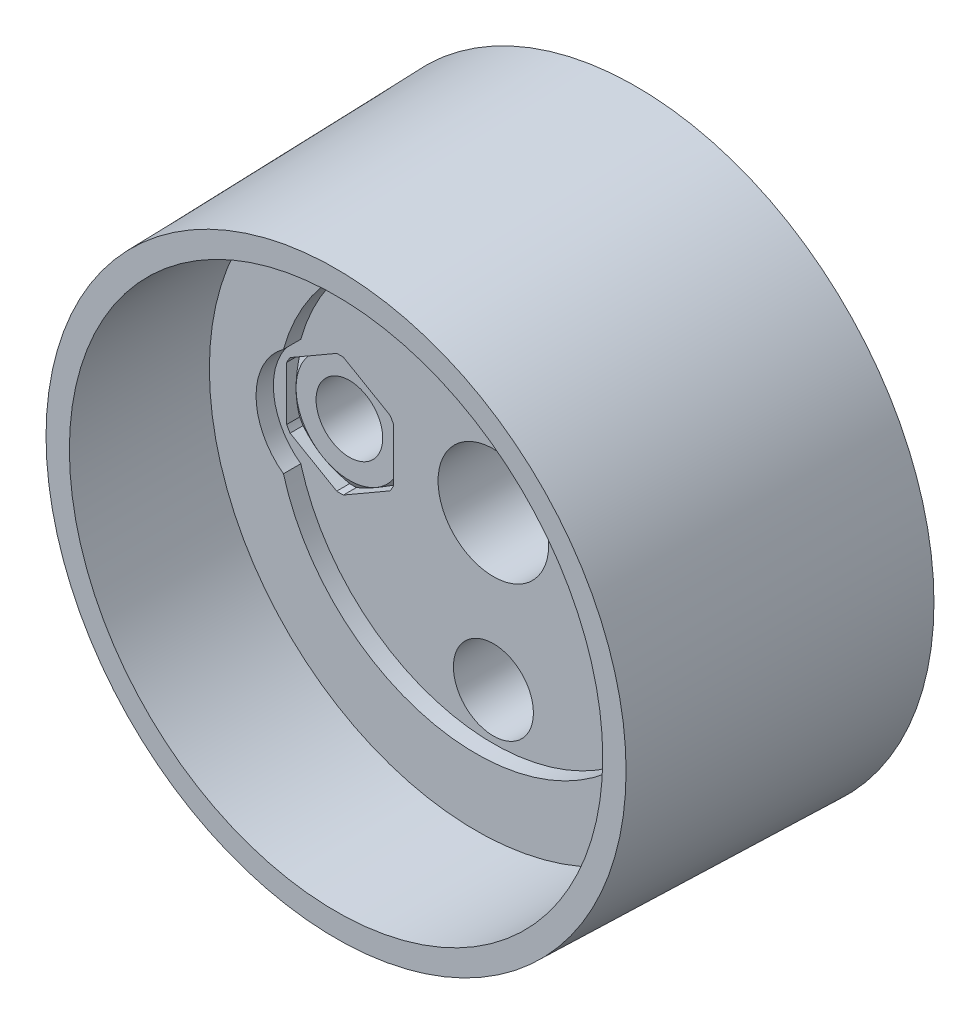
ISO-10303-21;
HEADER;
FILE_DESCRIPTION(('STEP AP214'),'2;1');
FILE_NAME('part.step','',(''),(''),'','','');
FILE_SCHEMA(('AUTOMOTIVE_DESIGN { 1 0 10303 214 1 1 1 1 }'));
ENDSEC;
DATA;
#1=APPLICATION_CONTEXT('core data for automotive mechanical design processes');
#2=APPLICATION_PROTOCOL_DEFINITION('international standard','automotive_design',2000,#1);
#3=PRODUCT_CONTEXT('',#1,'mechanical');
#4=PRODUCT('Part','Part','',(#3));
#5=PRODUCT_RELATED_PRODUCT_CATEGORY('part','',(#4));
#6=PRODUCT_DEFINITION_FORMATION('','',#4);
#7=PRODUCT_DEFINITION_CONTEXT('part definition',#1,'design');
#8=PRODUCT_DEFINITION('design','',#6,#7);
#9=PRODUCT_DEFINITION_SHAPE('','',#8);
#10=(LENGTH_UNIT() NAMED_UNIT(*) SI_UNIT(.MILLI.,.METRE.));
#11=(NAMED_UNIT(*) PLANE_ANGLE_UNIT() SI_UNIT($,.RADIAN.));
#12=(NAMED_UNIT(*) SI_UNIT($,.STERADIAN.) SOLID_ANGLE_UNIT());
#13=UNCERTAINTY_MEASURE_WITH_UNIT(LENGTH_MEASURE(1.E-05),#10,'distance_accuracy_value','');
#14=(GEOMETRIC_REPRESENTATION_CONTEXT(3) GLOBAL_UNCERTAINTY_ASSIGNED_CONTEXT((#13)) GLOBAL_UNIT_ASSIGNED_CONTEXT((#10,
#11,#12)) REPRESENTATION_CONTEXT('',''));
#15=CARTESIAN_POINT('',(0.,0.,0.));
#16=DIRECTION('',(0.,0.,1.));
#17=DIRECTION('',(1.,0.,0.));
#18=AXIS2_PLACEMENT_3D('',#15,#16,#17);
#19=CARTESIAN_POINT('',(-15.5,2.01752323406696,17.5));
#20=DIRECTION('',(1.,0.,0.));
#21=DIRECTION('',(0.,0.,-1.));
#22=AXIS2_PLACEMENT_3D('',#19,#20,#21);
#23=PLANE('',#22);
#24=DIRECTION('',(0.,0.,-1.));
#25=VECTOR('',#24,1.);
#26=CARTESIAN_POINT('',(-15.5,-2.01752323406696,17.5));
#27=LINE('',#26,#25);
#28=CARTESIAN_POINT('',(-15.5,-2.01752323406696,10.7));
#29=VERTEX_POINT('',#28);
#30=CARTESIAN_POINT('',(-15.5,-2.01752323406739,9.72287187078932));
#31=VERTEX_POINT('',#30);
#32=EDGE_CURVE('E569',#29,#31,#27,.T.);
#33=ORIENTED_EDGE('',*,*,#32,.T.);
#34=CARTESIAN_POINT('',(-15.5,-5.76597249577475,8.25779897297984));
#35=CARTESIAN_POINT('',(-15.5,-5.59687588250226,8.33798978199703));
#36=CARTESIAN_POINT('',(-15.5,-5.4273470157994,8.41728711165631));
#37=CARTESIAN_POINT('',(-15.5,-5.08719774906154,8.57359152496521));
#38=CARTESIAN_POINT('',(-15.5,-4.91657714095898,8.65059815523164));
#39=CARTESIAN_POINT('',(-15.5,-4.573038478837,8.80224733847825));
#40=CARTESIAN_POINT('',(-15.5,-4.40011275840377,8.8768725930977));
#41=CARTESIAN_POINT('',(-15.5,-4.05275942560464,9.02252859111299));
#42=CARTESIAN_POINT('',(-15.5,-3.87833189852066,9.09355953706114));
#43=CARTESIAN_POINT('',(-15.5,-3.5267551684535,9.23145430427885));
#44=CARTESIAN_POINT('',(-15.5,-3.34959642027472,9.29829393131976));
#45=CARTESIAN_POINT('',(-15.5,-2.99315183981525,9.4261477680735));
#46=CARTESIAN_POINT('',(-15.5,-2.81386578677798,9.48716136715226));
#47=CARTESIAN_POINT('',(-15.5,-2.45333237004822,9.60162040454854));
#48=CARTESIAN_POINT('',(-15.5,-2.27209060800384,9.65508329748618));
#49=CARTESIAN_POINT('',(-15.5,-1.90711401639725,9.75264886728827));
#50=CARTESIAN_POINT('',(-15.5,-1.72337975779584,9.7967536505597));
#51=CARTESIAN_POINT('',(-15.5,-1.347585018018,9.87463175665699));
#52=CARTESIAN_POINT('',(-15.5,-1.15544557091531,9.90803190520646));
#53=CARTESIAN_POINT('',(-15.5,-0.769135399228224,9.96019091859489));
#54=CARTESIAN_POINT('',(-15.5,-0.574964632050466,9.97894947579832));
#55=CARTESIAN_POINT('',(-15.5,-0.186597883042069,10.0001696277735));
#56=CARTESIAN_POINT('',(-15.5,0.00759396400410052,10.0027049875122));
#57=CARTESIAN_POINT('',(-15.5,0.39545886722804,9.99143676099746));
#58=CARTESIAN_POINT('',(-15.5,0.589132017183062,9.97763636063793));
#59=CARTESIAN_POINT('',(-15.5,0.927717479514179,9.94014618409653));
#60=CARTESIAN_POINT('',(-15.5,1.07300339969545,9.919688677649));
#61=CARTESIAN_POINT('',(-15.5,1.36228646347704,9.87104841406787));
#62=CARTESIAN_POINT('',(-15.5,1.50628337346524,9.84286428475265));
#63=CARTESIAN_POINT('',(-15.5,1.93665085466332,9.74814894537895));
#64=CARTESIAN_POINT('',(-15.5,2.22081358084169,9.67152729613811));
#65=CARTESIAN_POINT('',(-15.5,2.64530530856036,9.54155566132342));
#66=CARTESIAN_POINT('',(-15.5,2.78789680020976,9.49519501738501));
#67=CARTESIAN_POINT('',(-15.5,3.07170622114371,9.3983721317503));
#68=CARTESIAN_POINT('',(-15.5,3.21292403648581,9.34790955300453));
#69=CARTESIAN_POINT('',(-15.5,3.49327458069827,9.24392266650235));
#70=CARTESIAN_POINT('',(-15.5,3.63241467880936,9.19041803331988));
#71=CARTESIAN_POINT('',(-15.5,3.90955225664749,9.08064790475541));
#72=CARTESIAN_POINT('',(-15.5,4.04755008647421,9.02438329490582));
#73=CARTESIAN_POINT('',(-15.5,4.18507301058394,8.96700492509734));
#74=B_SPLINE_CURVE_WITH_KNOTS('',3,(#34,#35,#36,#37,#38,#39,#40,#41,#42,#43,#44,#45,#46,#47,#48,
#49,#50,#51,#52,#53,#54,#55,#56,#57,#58,#59,#60,#61,#62,#63,#64,#65,#66,#67,#68,#69,#70,#71,#72,
#73),.UNSPECIFIED.,.F.,.F.,(4,2,2,2,2,2,2,2,2,2,2,2,2,2,2,2,2,2,2,4),(0.,0.56145175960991,
1.12301391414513,1.68800364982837,2.25296151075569,2.82092664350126,3.38895124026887,
3.95564048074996,4.52220203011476,5.1067816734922,5.6913735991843,6.2733055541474,
6.8551240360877,7.29506136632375,7.73507687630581,8.61686739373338,9.06665546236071,
9.51648052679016,9.96366961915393,10.4107161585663),.UNSPECIFIED.);
#75=CARTESIAN_POINT('',(-15.5,0.,10.));
#76=VERTEX_POINT('',#75);
#77=EDGE_CURVE('E480',#31,#76,#74,.T.);
#78=ORIENTED_EDGE('',*,*,#77,.T.);
#79=CARTESIAN_POINT('',(-15.5,2.01752323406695,9.72287187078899));
#80=VERTEX_POINT('',#79);
#81=EDGE_CURVE('E472',#76,#80,#74,.T.);
#82=ORIENTED_EDGE('',*,*,#81,.T.);
#83=DIRECTION('',(0.,0.,-1.));
#84=VECTOR('',#83,1.);
#85=CARTESIAN_POINT('',(-15.5,2.01752323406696,17.5));
#86=LINE('',#85,#84);
#87=CARTESIAN_POINT('',(-15.5,2.01752323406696,10.7));
#88=VERTEX_POINT('',#87);
#89=EDGE_CURVE('E533',#88,#80,#86,.T.);
#90=ORIENTED_EDGE('',*,*,#89,.F.);
#91=DIRECTION('',(0.,1.,0.));
#92=VECTOR('',#91,1.);
#93=CARTESIAN_POINT('',(-15.5,4.15,10.7));
#94=LINE('',#93,#92);
#95=EDGE_CURVE('E737',#29,#88,#94,.T.);
#96=ORIENTED_EDGE('',*,*,#95,.F.);
#97=EDGE_LOOP('',(#33,#78,#82,#90,#96));
#98=FACE_BOUND('',#97,.T.);
#99=ADVANCED_FACE('F14',(#98),#23,.T.);
#100=CARTESIAN_POINT('',(-11.5,0.,17.5));
#101=DIRECTION('',(0.,0.,-1.));
#102=DIRECTION('',(-1.,0.,0.));
#103=AXIS2_PLACEMENT_3D('',#100,#101,#102);
#104=CYLINDRICAL_SURFACE('',#103,4.4800000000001);
#105=DIRECTION('',(0.,0.,-1.));
#106=VECTOR('',#105,1.);
#107=CARTESIAN_POINT('',(-15.2472263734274,-2.45533999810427,17.5));
#108=LINE('',#107,#106);
#109=CARTESIAN_POINT('',(-15.2472263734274,-2.45533999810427,10.7));
#110=VERTEX_POINT('',#109);
#111=CARTESIAN_POINT('',(-15.2472263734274,-2.45533999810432,9.72287187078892));
#112=VERTEX_POINT('',#111);
#113=EDGE_CURVE('E566',#110,#112,#108,.T.);
#114=ORIENTED_EDGE('',*,*,#113,.T.);
#115=CARTESIAN_POINT('',(-11.5,0.,9.72287187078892));
#116=DIRECTION('',(0.,0.,-1.));
#117=DIRECTION('',(-1.,0.,0.));
#118=AXIS2_PLACEMENT_3D('',#115,#116,#117);
#119=CIRCLE('',#118,4.4800000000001);
#120=EDGE_CURVE('E495',#112,#31,#119,.T.);
#121=ORIENTED_EDGE('',*,*,#120,.T.);
#122=ORIENTED_EDGE('',*,*,#32,.F.);
#123=CARTESIAN_POINT('',(-11.5,0.,10.7));
#124=DIRECTION('',(0.,0.,1.));
#125=DIRECTION('',(1.,0.,0.));
#126=AXIS2_PLACEMENT_3D('',#123,#124,#125);
#127=CIRCLE('',#126,4.4800000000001);
#128=EDGE_CURVE('E734',#110,#29,#127,.F.);
#129=ORIENTED_EDGE('',*,*,#128,.F.);
#130=EDGE_LOOP('',(#114,#121,#122,#129));
#131=FACE_BOUND('',#130,.T.);
#132=ADVANCED_FACE('F459',(#131),#104,.F.);
#133=CARTESIAN_POINT('',(-15.2472263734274,-2.45533999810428,17.5));
#134=DIRECTION('',(0.5,0.866025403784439,0.));
#135=DIRECTION('',(-0.866025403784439,0.5,0.));
#136=AXIS2_PLACEMENT_3D('',#133,#134,#135);
#137=PLANE('',#136);
#138=DIRECTION('',(0.,0.,-1.));
#139=VECTOR('',#138,1.);
#140=CARTESIAN_POINT('',(-11.7527736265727,-4.47286323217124,17.5));
#141=LINE('',#140,#139);
#142=CARTESIAN_POINT('',(-11.7527736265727,-4.47286323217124,10.7));
#143=VERTEX_POINT('',#142);
#144=CARTESIAN_POINT('',(-11.7527736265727,-4.47286323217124,9.72287187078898));
#145=VERTEX_POINT('',#144);
#146=EDGE_CURVE('E563',#143,#145,#141,.T.);
#147=ORIENTED_EDGE('',*,*,#146,.T.);
#148=CARTESIAN_POINT('',(-11.7525736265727,-4.47297870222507,9.72281182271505));
#149=CARTESIAN_POINT('',(-11.8384835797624,-4.42337856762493,9.74860406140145));
#150=CARTESIAN_POINT('',(-11.9247117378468,-4.37359471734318,9.77297975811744));
#151=CARTESIAN_POINT('',(-12.0978231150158,-4.2736488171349,9.81855016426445));
#152=CARTESIAN_POINT('',(-12.1847065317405,-4.22348665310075,9.83974387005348));
#153=CARTESIAN_POINT('',(-12.4465218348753,-4.07232751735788,9.89805910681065));
#154=CARTESIAN_POINT('',(-12.6223865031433,-3.97079200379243,9.92984310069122));
#155=CARTESIAN_POINT('',(-12.9719935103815,-3.76894630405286,9.97605705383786));
#156=CARTESIAN_POINT('',(-13.1456995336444,-3.66865708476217,9.99084734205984));
#157=CARTESIAN_POINT('',(-13.4934351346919,-3.46789184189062,10.0028915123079));
#158=CARTESIAN_POINT('',(-13.6674642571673,-3.36741608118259,10.00016180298));
#159=CARTESIAN_POINT('',(-13.9589183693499,-3.1991449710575,9.98114313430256));
#160=CARTESIAN_POINT('',(-14.0765907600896,-3.13120678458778,9.96948529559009));
#161=CARTESIAN_POINT('',(-14.3112480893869,-2.99572731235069,9.93875677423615));
#162=CARTESIAN_POINT('',(-14.4282327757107,-2.92818617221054,9.91968352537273));
#163=CARTESIAN_POINT('',(-14.662980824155,-2.79265432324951,9.87449792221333));
#164=CARTESIAN_POINT('',(-14.7807291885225,-2.72467227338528,9.84828343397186));
#165=CARTESIAN_POINT('',(-15.0149986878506,-2.5894167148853,9.7898407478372));
#166=CARTESIAN_POINT('',(-15.1315208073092,-2.52214263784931,9.75761783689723));
#167=CARTESIAN_POINT('',(-15.2474263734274,-2.45522452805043,9.72281182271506));
#168=B_SPLINE_CURVE_WITH_KNOTS('',3,(#148,#149,#150,#151,#152,#153,#154,#155,#156,#157,#158,
#159,#160,#161,#162,#163,#164,#165,#166,#167),.UNSPECIFIED.,.F.,.F.,(4,2,2,2,2,2,2,2,2,4),(0.,
0.307477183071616,0.615051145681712,1.2310302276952,1.83369217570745,2.43578977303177,
2.84471905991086,3.25378998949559,3.66905006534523,4.08394645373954),.UNSPECIFIED.);
#169=CARTESIAN_POINT('',(-13.5,-3.46410161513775,10.));
#170=VERTEX_POINT('',#169);
#171=EDGE_CURVE('E247',#145,#170,#168,.T.);
#172=ORIENTED_EDGE('',*,*,#171,.T.);
#173=EDGE_CURVE('E274',#170,#112,#168,.T.);
#174=ORIENTED_EDGE('',*,*,#173,.T.);
#175=ORIENTED_EDGE('',*,*,#113,.F.);
#176=DIRECTION('',(-0.866025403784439,0.5,0.));
#177=VECTOR('',#176,1.);
#178=CARTESIAN_POINT('',(-6.67200271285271,-7.40624768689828,10.7));
#179=LINE('',#178,#177);
#180=EDGE_CURVE('E731',#143,#110,#179,.T.);
#181=ORIENTED_EDGE('',*,*,#180,.F.);
#182=EDGE_LOOP('',(#147,#172,#174,#175,#181));
#183=FACE_BOUND('',#182,.T.);
#184=ADVANCED_FACE('F465',(#183),#137,.T.);
#185=CARTESIAN_POINT('',(-11.5,-7.30318583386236E-13,17.5));
#186=DIRECTION('',(0.,0.,-1.));
#187=DIRECTION('',(-1.,0.,0.));
#188=AXIS2_PLACEMENT_3D('',#185,#186,#187);
#189=CYLINDRICAL_SURFACE('',#188,4.47999999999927);
#190=DIRECTION('',(0.,0.,-1.));
#191=VECTOR('',#190,1.);
#192=CARTESIAN_POINT('',(-11.2472263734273,-4.47286323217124,17.5));
#193=LINE('',#192,#191);
#194=CARTESIAN_POINT('',(-11.2472263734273,-4.47286323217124,10.7));
#195=VERTEX_POINT('',#194);
#196=CARTESIAN_POINT('',(-11.2472263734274,-4.4728632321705,9.7228718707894));
#197=VERTEX_POINT('',#196);
#198=EDGE_CURVE('E560',#195,#197,#193,.T.);
#199=ORIENTED_EDGE('',*,*,#198,.T.);
#200=CARTESIAN_POINT('',(-11.5,0.,9.7228718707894));
#201=DIRECTION('',(0.,0.,-1.));
#202=DIRECTION('',(-1.,0.,0.));
#203=AXIS2_PLACEMENT_3D('',#200,#201,#202);
#204=CIRCLE('',#203,4.47999999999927);
#205=EDGE_CURVE('E319',#197,#145,#204,.T.);
#206=ORIENTED_EDGE('',*,*,#205,.T.);
#207=ORIENTED_EDGE('',*,*,#146,.F.);
#208=CARTESIAN_POINT('',(-11.5,-7.30318583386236E-13,10.7));
#209=DIRECTION('',(0.,0.,1.));
#210=DIRECTION('',(1.,0.,0.));
#211=AXIS2_PLACEMENT_3D('',#208,#209,#210);
#212=CIRCLE('',#211,4.47999999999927);
#213=EDGE_CURVE('E728',#195,#143,#212,.F.);
#214=ORIENTED_EDGE('',*,*,#213,.F.);
#215=EDGE_LOOP('',(#199,#206,#207,#214));
#216=FACE_BOUND('',#215,.T.);
#217=ADVANCED_FACE('F310',(#216),#189,.F.);
#218=CARTESIAN_POINT('',(-11.2472263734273,-4.47286323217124,17.5));
#219=DIRECTION('',(-0.5,0.866025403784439,0.));
#220=DIRECTION('',(-0.866025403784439,-0.5,0.));
#221=AXIS2_PLACEMENT_3D('',#218,#219,#220);
#222=PLANE('',#221);
#223=DIRECTION('',(0.,0.,-1.));
#224=VECTOR('',#223,1.);
#225=CARTESIAN_POINT('',(-7.75277362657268,-2.45533999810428,17.5));
#226=LINE('',#225,#224);
#227=CARTESIAN_POINT('',(-7.75277362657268,-2.45533999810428,10.7));
#228=VERTEX_POINT('',#227);
#229=CARTESIAN_POINT('',(-7.75277362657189,-2.45533999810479,9.72287187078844));
#230=VERTEX_POINT('',#229);
#231=EDGE_CURVE('E557',#228,#230,#226,.T.);
#232=ORIENTED_EDGE('',*,*,#231,.T.);
#233=CARTESIAN_POINT('',(-7.75257362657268,-2.45522452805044,9.72281182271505));
#234=CARTESIAN_POINT('',(-7.83848357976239,-2.50482466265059,9.74860406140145));
#235=CARTESIAN_POINT('',(-7.92471173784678,-2.55460851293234,9.77297975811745));
#236=CARTESIAN_POINT('',(-8.09782311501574,-2.65455441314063,9.81855016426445));
#237=CARTESIAN_POINT('',(-8.18470653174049,-2.70471657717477,9.83974387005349));
#238=CARTESIAN_POINT('',(-8.44652183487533,-2.85587571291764,9.89805910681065));
#239=CARTESIAN_POINT('',(-8.62238650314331,-2.9574112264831,9.92984310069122));
#240=CARTESIAN_POINT('',(-8.97199351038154,-3.15925692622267,9.97605705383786));
#241=CARTESIAN_POINT('',(-9.14569953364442,-3.25954614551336,9.99084734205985));
#242=CARTESIAN_POINT('',(-9.49343513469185,-3.46031138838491,10.0028915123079));
#243=CARTESIAN_POINT('',(-9.66746425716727,-3.56078714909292,10.00016180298));
#244=CARTESIAN_POINT('',(-9.95891836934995,-3.72905825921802,9.98114313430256));
#245=CARTESIAN_POINT('',(-10.0765907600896,-3.79699644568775,9.96948529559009));
#246=CARTESIAN_POINT('',(-10.3112480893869,-3.93247591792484,9.93875677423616));
#247=CARTESIAN_POINT('',(-10.4282327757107,-4.00001705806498,9.91968352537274));
#248=CARTESIAN_POINT('',(-10.662980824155,-4.135548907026,9.87449792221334));
#249=CARTESIAN_POINT('',(-10.7807291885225,-4.20353095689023,9.84828343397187));
#250=CARTESIAN_POINT('',(-11.0149986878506,-4.33878651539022,9.78984074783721));
#251=CARTESIAN_POINT('',(-11.1315208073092,-4.40606059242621,9.75761783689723));
#252=CARTESIAN_POINT('',(-11.2474263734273,-4.47297870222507,9.72281182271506));
#253=B_SPLINE_CURVE_WITH_KNOTS('',3,(#233,#234,#235,#236,#237,#238,#239,#240,#241,#242,#243,
#244,#245,#246,#247,#248,#249,#250,#251,#252),.UNSPECIFIED.,.F.,.F.,(4,2,2,2,2,2,2,2,2,4),(0.,
0.307477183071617,0.615051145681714,1.23103022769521,1.83369217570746,2.43578977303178,
2.84471905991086,3.25378998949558,3.66905006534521,4.08394645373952),.UNSPECIFIED.);
#254=CARTESIAN_POINT('',(-9.5,-3.46410161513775,10.));
#255=VERTEX_POINT('',#254);
#256=EDGE_CURVE('E313',#230,#255,#253,.T.);
#257=ORIENTED_EDGE('',*,*,#256,.T.);
#258=EDGE_CURVE('E320',#255,#197,#253,.T.);
#259=ORIENTED_EDGE('',*,*,#258,.T.);
#260=ORIENTED_EDGE('',*,*,#198,.F.);
#261=DIRECTION('',(-0.866025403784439,-0.5,0.));
#262=VECTOR('',#261,1.);
#263=CARTESIAN_POINT('',(0.922002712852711,2.55304445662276,10.7));
#264=LINE('',#263,#262);
#265=EDGE_CURVE('E725',#228,#195,#264,.T.);
#266=ORIENTED_EDGE('',*,*,#265,.F.);
#267=EDGE_LOOP('',(#232,#257,#259,#260,#266));
#268=FACE_BOUND('',#267,.T.);
#269=ADVANCED_FACE('F305',(#268),#222,.T.);
#270=CARTESIAN_POINT('',(-11.5000000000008,4.67941657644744E-13,17.5));
#271=DIRECTION('',(0.,0.,-1.));
#272=DIRECTION('',(-1.,0.,0.));
#273=AXIS2_PLACEMENT_3D('',#270,#271,#272);
#274=CYLINDRICAL_SURFACE('',#273,4.48000000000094);
#275=DIRECTION('',(0.,0.,-1.));
#276=VECTOR('',#275,1.);
#277=CARTESIAN_POINT('',(-7.5,-2.01752323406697,17.5));
#278=LINE('',#277,#276);
#279=CARTESIAN_POINT('',(-7.5,-2.01752323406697,10.7));
#280=VERTEX_POINT('',#279);
#281=CARTESIAN_POINT('',(-7.5,-2.01752323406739,9.72287187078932));
#282=VERTEX_POINT('',#281);
#283=EDGE_CURVE('E555',#280,#282,#278,.T.);
#284=ORIENTED_EDGE('',*,*,#283,.T.);
#285=CARTESIAN_POINT('',(-11.5,0.,9.72287187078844));
#286=DIRECTION('',(0.,0.,-1.));
#287=DIRECTION('',(-1.,0.,0.));
#288=AXIS2_PLACEMENT_3D('',#285,#286,#287);
#289=CIRCLE('',#288,4.48000000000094);
#290=EDGE_CURVE('E242',#282,#230,#289,.T.);
#291=ORIENTED_EDGE('',*,*,#290,.T.);
#292=ORIENTED_EDGE('',*,*,#231,.F.);
#293=CARTESIAN_POINT('',(-11.5000000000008,4.67941657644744E-13,10.7));
#294=DIRECTION('',(0.,0.,1.));
#295=DIRECTION('',(1.,0.,0.));
#296=AXIS2_PLACEMENT_3D('',#293,#294,#295);
#297=CIRCLE('',#296,4.48000000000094);
#298=EDGE_CURVE('E722',#280,#228,#297,.F.);
#299=ORIENTED_EDGE('',*,*,#298,.F.);
#300=EDGE_LOOP('',(#284,#291,#292,#299));
#301=FACE_BOUND('',#300,.T.);
#302=ADVANCED_FACE('F301',(#301),#274,.F.);
#303=CARTESIAN_POINT('',(-7.5,-2.01752323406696,17.5));
#304=DIRECTION('',(-1.,0.,0.));
#305=DIRECTION('',(0.,0.,1.));
#306=AXIS2_PLACEMENT_3D('',#303,#304,#305);
#307=PLANE('',#306);
#308=DIRECTION('',(0.,0.,-1.));
#309=VECTOR('',#308,1.);
#310=CARTESIAN_POINT('',(-7.5,2.01752323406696,17.5));
#311=LINE('',#310,#309);
#312=CARTESIAN_POINT('',(-7.5,2.01752323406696,10.7));
#313=VERTEX_POINT('',#312);
#314=CARTESIAN_POINT('',(-7.49999999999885,2.01752323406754,9.72287187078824));
#315=VERTEX_POINT('',#314);
#316=EDGE_CURVE('E273',#313,#315,#311,.T.);
#317=ORIENTED_EDGE('',*,*,#316,.T.);
#318=CARTESIAN_POINT('',(-7.5,-5.76597249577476,8.25779897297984));
#319=CARTESIAN_POINT('',(-7.5,-5.59687588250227,8.33798978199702));
#320=CARTESIAN_POINT('',(-7.5,-5.42734701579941,8.4172871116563));
#321=CARTESIAN_POINT('',(-7.5,-5.08719774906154,8.5735915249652));
#322=CARTESIAN_POINT('',(-7.5,-4.91657714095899,8.65059815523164));
#323=CARTESIAN_POINT('',(-7.5,-4.57303847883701,8.80224733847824));
#324=CARTESIAN_POINT('',(-7.5,-4.40011275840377,8.87687259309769));
#325=CARTESIAN_POINT('',(-7.5,-4.05275942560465,9.02252859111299));
#326=CARTESIAN_POINT('',(-7.5,-3.87833189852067,9.09355953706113));
#327=CARTESIAN_POINT('',(-7.5,-3.52675516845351,9.23145430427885));
#328=CARTESIAN_POINT('',(-7.5,-3.34959642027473,9.29829393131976));
#329=CARTESIAN_POINT('',(-7.5,-2.99315183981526,9.4261477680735));
#330=CARTESIAN_POINT('',(-7.5,-2.81386578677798,9.48716136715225));
#331=CARTESIAN_POINT('',(-7.5,-2.45333237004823,9.60162040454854));
#332=CARTESIAN_POINT('',(-7.5,-2.27209060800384,9.65508329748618));
#333=CARTESIAN_POINT('',(-7.5,-1.90711401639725,9.75264886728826));
#334=CARTESIAN_POINT('',(-7.5,-1.72337975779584,9.7967536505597));
#335=CARTESIAN_POINT('',(-7.5,-1.347585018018,9.87463175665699));
#336=CARTESIAN_POINT('',(-7.5,-1.15544557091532,9.90803190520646));
#337=CARTESIAN_POINT('',(-7.5,-0.769135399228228,9.96019091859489));
#338=CARTESIAN_POINT('',(-7.5,-0.57496463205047,9.97894947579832));
#339=CARTESIAN_POINT('',(-7.5,-0.186597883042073,10.0001696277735));
#340=CARTESIAN_POINT('',(-7.5,0.00759396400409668,10.0027049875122));
#341=CARTESIAN_POINT('',(-7.5,0.395458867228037,9.99143676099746));
#342=CARTESIAN_POINT('',(-7.5,0.589132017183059,9.97763636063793));
#343=CARTESIAN_POINT('',(-7.5,0.927717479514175,9.94014618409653));
#344=CARTESIAN_POINT('',(-7.5,1.07300339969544,9.919688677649));
#345=CARTESIAN_POINT('',(-7.5,1.36228646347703,9.87104841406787));
#346=CARTESIAN_POINT('',(-7.5,1.50628337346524,9.84286428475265));
#347=CARTESIAN_POINT('',(-7.5,1.93665085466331,9.74814894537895));
#348=CARTESIAN_POINT('',(-7.5,2.22081358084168,9.67152729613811));
#349=CARTESIAN_POINT('',(-7.5,2.64530530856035,9.54155566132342));
#350=CARTESIAN_POINT('',(-7.5,2.78789680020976,9.49519501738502));
#351=CARTESIAN_POINT('',(-7.5,3.0717062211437,9.3983721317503));
#352=CARTESIAN_POINT('',(-7.5,3.21292403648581,9.34790955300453));
#353=CARTESIAN_POINT('',(-7.5,3.49327458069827,9.24392266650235));
#354=CARTESIAN_POINT('',(-7.5,3.63241467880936,9.19041803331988));
#355=CARTESIAN_POINT('',(-7.5,3.90955225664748,9.08064790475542));
#356=CARTESIAN_POINT('',(-7.5,4.0475500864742,9.02438329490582));
#357=CARTESIAN_POINT('',(-7.5,4.18507301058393,8.96700492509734));
#358=B_SPLINE_CURVE_WITH_KNOTS('',3,(#318,#319,#320,#321,#322,#323,#324,#325,#326,#327,#328,
#329,#330,#331,#332,#333,#334,#335,#336,#337,#338,#339,#340,#341,#342,#343,#344,#345,#346,#347,
#348,#349,#350,#351,#352,#353,#354,#355,#356,#357),.UNSPECIFIED.,.F.,.F.,(4,2,2,2,2,2,2,2,2,2,2,
2,2,2,2,2,2,2,2,4),(0.,0.56145175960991,1.12301391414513,1.68800364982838,2.25296151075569,
2.82092664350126,3.38895124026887,3.95564048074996,4.52220203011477,5.10678167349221,
5.69137359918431,6.2733055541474,6.85512403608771,7.29506136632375,7.73507687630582,
8.61686739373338,9.06665546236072,9.51648052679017,9.96366961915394,10.4107161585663),.UNSPECIFIED.);
#359=CARTESIAN_POINT('',(-7.5,0.,10.));
#360=VERTEX_POINT('',#359);
#361=EDGE_CURVE('E249',#315,#360,#358,.F.);
#362=ORIENTED_EDGE('',*,*,#361,.T.);
#363=EDGE_CURVE('E236',#360,#282,#358,.F.);
#364=ORIENTED_EDGE('',*,*,#363,.T.);
#365=ORIENTED_EDGE('',*,*,#283,.F.);
#366=DIRECTION('',(0.,-1.,0.));
#367=VECTOR('',#366,1.);
#368=CARTESIAN_POINT('',(-7.5,4.15,10.7));
#369=LINE('',#368,#367);
#370=EDGE_CURVE('E719',#313,#280,#369,.T.);
#371=ORIENTED_EDGE('',*,*,#370,.F.);
#372=EDGE_LOOP('',(#317,#362,#364,#365,#371));
#373=FACE_BOUND('',#372,.T.);
#374=ADVANCED_FACE('F271',(#373),#307,.T.);
#375=CARTESIAN_POINT('',(-11.5000000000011,-6.41414005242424E-13,17.5));
#376=DIRECTION('',(0.,0.,-1.));
#377=DIRECTION('',(-1.,0.,0.));
#378=AXIS2_PLACEMENT_3D('',#375,#376,#377);
#379=CYLINDRICAL_SURFACE('',#378,4.48000000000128);
#380=DIRECTION('',(0.,0.,-1.));
#381=VECTOR('',#380,1.);
#382=CARTESIAN_POINT('',(-7.75277362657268,2.45533999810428,17.5));
#383=LINE('',#382,#381);
#384=CARTESIAN_POINT('',(-7.75277362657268,2.45533999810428,10.7));
#385=VERTEX_POINT('',#384);
#386=CARTESIAN_POINT('',(-7.75277362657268,2.45533999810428,9.72287187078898));
#387=VERTEX_POINT('',#386);
#388=EDGE_CURVE('E551',#385,#387,#383,.T.);
#389=ORIENTED_EDGE('',*,*,#388,.T.);
#390=CARTESIAN_POINT('',(-11.5,0.,9.72287187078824));
#391=DIRECTION('',(0.,0.,-1.));
#392=DIRECTION('',(-1.,0.,0.));
#393=AXIS2_PLACEMENT_3D('',#390,#391,#392);
#394=CIRCLE('',#393,4.48000000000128);
#395=EDGE_CURVE('E275',#387,#315,#394,.T.);
#396=ORIENTED_EDGE('',*,*,#395,.T.);
#397=ORIENTED_EDGE('',*,*,#316,.F.);
#398=CARTESIAN_POINT('',(-11.5000000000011,-6.41414005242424E-13,10.7));
#399=DIRECTION('',(0.,0.,1.));
#400=DIRECTION('',(1.,0.,0.));
#401=AXIS2_PLACEMENT_3D('',#398,#399,#400);
#402=CIRCLE('',#401,4.48000000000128);
#403=EDGE_CURVE('E716',#385,#313,#402,.F.);
#404=ORIENTED_EDGE('',*,*,#403,.F.);
#405=EDGE_LOOP('',(#389,#396,#397,#404));
#406=FACE_BOUND('',#405,.T.);
#407=ADVANCED_FACE('F300',(#406),#379,.F.);
#408=CARTESIAN_POINT('',(-7.75277362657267,2.45533999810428,17.5));
#409=DIRECTION('',(-0.5,-0.866025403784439,0.));
#410=DIRECTION('',(0.866025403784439,-0.5,0.));
#411=AXIS2_PLACEMENT_3D('',#408,#409,#410);
#412=PLANE('',#411);
#413=DIRECTION('',(0.,0.,-1.));
#414=VECTOR('',#413,1.);
#415=CARTESIAN_POINT('',(-11.2472263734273,4.47286323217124,17.5));
#416=LINE('',#415,#414);
#417=CARTESIAN_POINT('',(-11.2472263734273,4.47286323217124,10.7));
#418=VERTEX_POINT('',#417);
#419=CARTESIAN_POINT('',(-11.2472263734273,4.47286323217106,9.72287187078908));
#420=VERTEX_POINT('',#419);
#421=EDGE_CURVE('E548',#418,#420,#416,.T.);
#422=ORIENTED_EDGE('',*,*,#421,.T.);
#423=CARTESIAN_POINT('',(-11.2474263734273,4.47297870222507,9.72281182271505));
#424=CARTESIAN_POINT('',(-11.1615164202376,4.42337856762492,9.74860406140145));
#425=CARTESIAN_POINT('',(-11.0752882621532,4.37359471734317,9.77297975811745));
#426=CARTESIAN_POINT('',(-10.9021768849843,4.27364881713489,9.81855016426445));
#427=CARTESIAN_POINT('',(-10.8152934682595,4.22348665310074,9.83974387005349));
#428=CARTESIAN_POINT('',(-10.5534781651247,4.07232751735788,9.89805910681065));
#429=CARTESIAN_POINT('',(-10.3776134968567,3.97079200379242,9.92984310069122));
#430=CARTESIAN_POINT('',(-10.0280064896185,3.76894630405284,9.97605705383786));
#431=CARTESIAN_POINT('',(-9.85430046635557,3.66865708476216,9.99084734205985));
#432=CARTESIAN_POINT('',(-9.50656486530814,3.46789184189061,10.0028915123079));
#433=CARTESIAN_POINT('',(-9.33253574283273,3.36741608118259,10.00016180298));
#434=CARTESIAN_POINT('',(-9.04108163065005,3.1991449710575,9.98114313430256));
#435=CARTESIAN_POINT('',(-8.92340923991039,3.13120678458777,9.96948529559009));
#436=CARTESIAN_POINT('',(-8.68875191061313,2.99572731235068,9.93875677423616));
#437=CARTESIAN_POINT('',(-8.57176722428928,2.92818617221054,9.91968352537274));
#438=CARTESIAN_POINT('',(-8.33701917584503,2.79265432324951,9.87449792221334));
#439=CARTESIAN_POINT('',(-8.2192708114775,2.72467227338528,9.84828343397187));
#440=CARTESIAN_POINT('',(-7.98500131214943,2.5894167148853,9.78984074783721));
#441=CARTESIAN_POINT('',(-7.86847919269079,2.52214263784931,9.75761783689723));
#442=CARTESIAN_POINT('',(-7.75257362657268,2.45522452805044,9.72281182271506));
#443=B_SPLINE_CURVE_WITH_KNOTS('',3,(#423,#424,#425,#426,#427,#428,#429,#430,#431,#432,#433,
#434,#435,#436,#437,#438,#439,#440,#441,#442),.UNSPECIFIED.,.F.,.F.,(4,2,2,2,2,2,2,2,2,4),(0.,
0.307477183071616,0.615051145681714,1.23103022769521,1.83369217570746,2.43578977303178,
2.84471905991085,3.25378998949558,3.66905006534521,4.08394645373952),.UNSPECIFIED.);
#444=CARTESIAN_POINT('',(-9.5,3.46410161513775,10.));
#445=VERTEX_POINT('',#444);
#446=EDGE_CURVE('E489',#420,#445,#443,.T.);
#447=ORIENTED_EDGE('',*,*,#446,.T.);
#448=EDGE_CURVE('E267',#445,#387,#443,.T.);
#449=ORIENTED_EDGE('',*,*,#448,.T.);
#450=ORIENTED_EDGE('',*,*,#388,.F.);
#451=DIRECTION('',(0.866025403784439,-0.5,0.));
#452=VECTOR('',#451,1.);
#453=CARTESIAN_POINT('',(-2.67200271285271,-0.478044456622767,10.7));
#454=LINE('',#453,#452);
#455=EDGE_CURVE('E713',#418,#385,#454,.T.);
#456=ORIENTED_EDGE('',*,*,#455,.F.);
#457=EDGE_LOOP('',(#422,#447,#449,#450,#456));
#458=FACE_BOUND('',#457,.T.);
#459=ADVANCED_FACE('F496',(#458),#412,.T.);
#460=CARTESIAN_POINT('',(-11.5,1.70870262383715E-13,17.5));
#461=DIRECTION('',(0.,0.,-1.));
#462=DIRECTION('',(-1.,0.,0.));
#463=AXIS2_PLACEMENT_3D('',#460,#461,#462);
#464=CYLINDRICAL_SURFACE('',#463,4.47999999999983);
#465=DIRECTION('',(0.,0.,-1.));
#466=VECTOR('',#465,1.);
#467=CARTESIAN_POINT('',(-11.7527736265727,4.47286323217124,17.5));
#468=LINE('',#467,#466);
#469=CARTESIAN_POINT('',(-11.7527736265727,4.47286323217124,10.7));
#470=VERTEX_POINT('',#469);
#471=CARTESIAN_POINT('',(-11.7527736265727,4.47286323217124,9.72287187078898));
#472=VERTEX_POINT('',#471);
#473=EDGE_CURVE('E545',#470,#472,#468,.T.);
#474=ORIENTED_EDGE('',*,*,#473,.T.);
#475=CARTESIAN_POINT('',(-11.5,0.,9.72287187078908));
#476=DIRECTION('',(0.,0.,-1.));
#477=DIRECTION('',(-1.,0.,0.));
#478=AXIS2_PLACEMENT_3D('',#475,#476,#477);
#479=CIRCLE('',#478,4.47999999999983);
#480=EDGE_CURVE('E486',#472,#420,#479,.T.);
#481=ORIENTED_EDGE('',*,*,#480,.T.);
#482=ORIENTED_EDGE('',*,*,#421,.F.);
#483=CARTESIAN_POINT('',(-11.5,1.70870262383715E-13,10.7));
#484=DIRECTION('',(0.,0.,1.));
#485=DIRECTION('',(1.,0.,0.));
#486=AXIS2_PLACEMENT_3D('',#483,#484,#485);
#487=CIRCLE('',#486,4.47999999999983);
#488=EDGE_CURVE('E710',#470,#418,#487,.F.);
#489=ORIENTED_EDGE('',*,*,#488,.F.);
#490=EDGE_LOOP('',(#474,#481,#482,#489));
#491=FACE_BOUND('',#490,.T.);
#492=ADVANCED_FACE('F500',(#491),#464,.F.);
#493=CARTESIAN_POINT('',(-11.7527736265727,4.47286323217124,17.5));
#494=DIRECTION('',(0.5,-0.866025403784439,0.));
#495=DIRECTION('',(0.866025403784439,0.5,0.));
#496=AXIS2_PLACEMENT_3D('',#493,#494,#495);
#497=PLANE('',#496);
#498=DIRECTION('',(0.,0.,-1.));
#499=VECTOR('',#498,1.);
#500=CARTESIAN_POINT('',(-15.2472263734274,2.45533999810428,17.5));
#501=LINE('',#500,#499);
#502=CARTESIAN_POINT('',(-15.2472263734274,2.45533999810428,10.7));
#503=VERTEX_POINT('',#502);
#504=CARTESIAN_POINT('',(-15.2472263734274,2.45533999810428,9.72287187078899));
#505=VERTEX_POINT('',#504);
#506=EDGE_CURVE('E542',#503,#505,#501,.T.);
#507=ORIENTED_EDGE('',*,*,#506,.T.);
#508=CARTESIAN_POINT('',(-15.2474263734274,2.45522452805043,9.72281182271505));
#509=CARTESIAN_POINT('',(-15.1615164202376,2.50482466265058,9.74860406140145));
#510=CARTESIAN_POINT('',(-15.0752882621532,2.55460851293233,9.77297975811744));
#511=CARTESIAN_POINT('',(-14.9021768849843,2.65455441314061,9.81855016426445));
#512=CARTESIAN_POINT('',(-14.8152934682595,2.70471657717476,9.83974387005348));
#513=CARTESIAN_POINT('',(-14.5534781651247,2.85587571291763,9.89805910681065));
#514=CARTESIAN_POINT('',(-14.3776134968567,2.95741122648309,9.92984310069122));
#515=CARTESIAN_POINT('',(-14.0280064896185,3.15925692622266,9.97605705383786));
#516=CARTESIAN_POINT('',(-13.8543004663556,3.25954614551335,9.99084734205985));
#517=CARTESIAN_POINT('',(-13.5065648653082,3.4603113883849,10.0028915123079));
#518=CARTESIAN_POINT('',(-13.3325357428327,3.56078714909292,10.00016180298));
#519=CARTESIAN_POINT('',(-13.0410816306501,3.72905825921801,9.98114313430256));
#520=CARTESIAN_POINT('',(-12.9234092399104,3.79699644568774,9.96948529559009));
#521=CARTESIAN_POINT('',(-12.6887519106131,3.93247591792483,9.93875677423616));
#522=CARTESIAN_POINT('',(-12.5717672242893,4.00001705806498,9.91968352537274));
#523=CARTESIAN_POINT('',(-12.337019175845,4.135548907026,9.87449792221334));
#524=CARTESIAN_POINT('',(-12.2192708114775,4.20353095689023,9.84828343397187));
#525=CARTESIAN_POINT('',(-11.9850013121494,4.33878651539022,9.78984074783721));
#526=CARTESIAN_POINT('',(-11.8684791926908,4.40606059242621,9.75761783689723));
#527=CARTESIAN_POINT('',(-11.7525736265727,4.47297870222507,9.72281182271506));
#528=B_SPLINE_CURVE_WITH_KNOTS('',3,(#508,#509,#510,#511,#512,#513,#514,#515,#516,#517,#518,
#519,#520,#521,#522,#523,#524,#525,#526,#527),.UNSPECIFIED.,.F.,.F.,(4,2,2,2,2,2,2,2,2,4),(0.,
0.307477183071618,0.615051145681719,1.23103022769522,1.83369217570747,2.4357897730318,
2.84471905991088,3.25378998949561,3.66905006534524,4.08394645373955),.UNSPECIFIED.);
#529=CARTESIAN_POINT('',(-13.5,3.46410161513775,10.));
#530=VERTEX_POINT('',#529);
#531=EDGE_CURVE('E29',#505,#530,#528,.T.);
#532=ORIENTED_EDGE('',*,*,#531,.T.);
#533=EDGE_CURVE('E490',#530,#472,#528,.T.);
#534=ORIENTED_EDGE('',*,*,#533,.T.);
#535=ORIENTED_EDGE('',*,*,#473,.F.);
#536=DIRECTION('',(0.866025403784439,0.5,0.));
#537=VECTOR('',#536,1.);
#538=CARTESIAN_POINT('',(-3.0779972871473,9.48124768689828,10.7));
#539=LINE('',#538,#537);
#540=EDGE_CURVE('E707',#503,#470,#539,.T.);
#541=ORIENTED_EDGE('',*,*,#540,.F.);
#542=EDGE_LOOP('',(#507,#532,#534,#535,#541));
#543=FACE_BOUND('',#542,.T.);
#544=ADVANCED_FACE('F503',(#543),#497,.T.);
#545=CARTESIAN_POINT('',(-11.5,0.,17.5));
#546=DIRECTION('',(0.,0.,-1.));
#547=DIRECTION('',(-1.,0.,0.));
#548=AXIS2_PLACEMENT_3D('',#545,#546,#547);
#549=CYLINDRICAL_SURFACE('',#548,4.48);
#550=ORIENTED_EDGE('',*,*,#89,.T.);
#551=CARTESIAN_POINT('',(-11.5,0.,9.72287187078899));
#552=DIRECTION('',(0.,0.,-1.));
#553=DIRECTION('',(-1.,0.,0.));
#554=AXIS2_PLACEMENT_3D('',#551,#552,#553);
#555=CIRCLE('',#554,4.48);
#556=EDGE_CURVE('E9',#80,#505,#555,.T.);
#557=ORIENTED_EDGE('',*,*,#556,.T.);
#558=ORIENTED_EDGE('',*,*,#506,.F.);
#559=CARTESIAN_POINT('',(-11.5,0.,10.7));
#560=DIRECTION('',(0.,0.,1.));
#561=DIRECTION('',(1.,0.,0.));
#562=AXIS2_PLACEMENT_3D('',#559,#560,#561);
#563=CIRCLE('',#562,4.48);
#564=EDGE_CURVE('E704',#88,#503,#563,.F.);
#565=ORIENTED_EDGE('',*,*,#564,.F.);
#566=EDGE_LOOP('',(#550,#557,#558,#565));
#567=FACE_BOUND('',#566,.T.);
#568=ADVANCED_FACE('F405',(#567),#549,.F.);
#569=CARTESIAN_POINT('',(7.5,2.01752323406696,17.5));
#570=DIRECTION('',(1.,0.,0.));
#571=DIRECTION('',(0.,0.,-1.));
#572=AXIS2_PLACEMENT_3D('',#569,#570,#571);
#573=PLANE('',#572);
#574=DIRECTION('',(0.,0.,-1.));
#575=VECTOR('',#574,1.);
#576=CARTESIAN_POINT('',(7.5,-2.01752323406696,17.5));
#577=LINE('',#576,#575);
#578=CARTESIAN_POINT('',(7.5,-2.01752323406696,10.7));
#579=VERTEX_POINT('',#578);
#580=CARTESIAN_POINT('',(7.5,-2.01752323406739,9.72287187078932));
#581=VERTEX_POINT('',#580);
#582=EDGE_CURVE('E604',#579,#581,#577,.T.);
#583=ORIENTED_EDGE('',*,*,#582,.T.);
#584=CARTESIAN_POINT('',(7.5,-5.76597249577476,8.25779897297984));
#585=CARTESIAN_POINT('',(7.5,-5.59687588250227,8.33798978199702));
#586=CARTESIAN_POINT('',(7.5,-5.42734701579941,8.4172871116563));
#587=CARTESIAN_POINT('',(7.5,-5.08719774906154,8.5735915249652));
#588=CARTESIAN_POINT('',(7.5,-4.91657714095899,8.65059815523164));
#589=CARTESIAN_POINT('',(7.5,-4.57303847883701,8.80224733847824));
#590=CARTESIAN_POINT('',(7.5,-4.40011275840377,8.8768725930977));
#591=CARTESIAN_POINT('',(7.5,-4.05275942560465,9.02252859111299));
#592=CARTESIAN_POINT('',(7.5,-3.87833189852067,9.09355953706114));
#593=CARTESIAN_POINT('',(7.5,-3.5267551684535,9.23145430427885));
#594=CARTESIAN_POINT('',(7.5,-3.34959642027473,9.29829393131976));
#595=CARTESIAN_POINT('',(7.5,-2.99315183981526,9.4261477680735));
#596=CARTESIAN_POINT('',(7.5,-2.81386578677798,9.48716136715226));
#597=CARTESIAN_POINT('',(7.5,-2.45333237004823,9.60162040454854));
#598=CARTESIAN_POINT('',(7.5,-2.27209060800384,9.65508329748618));
#599=CARTESIAN_POINT('',(7.5,-1.90711401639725,9.75264886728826));
#600=CARTESIAN_POINT('',(7.5,-1.72337975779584,9.7967536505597));
#601=CARTESIAN_POINT('',(7.5,-1.347585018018,9.87463175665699));
#602=CARTESIAN_POINT('',(7.5,-1.15544557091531,9.90803190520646));
#603=CARTESIAN_POINT('',(7.5,-0.769135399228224,9.96019091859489));
#604=CARTESIAN_POINT('',(7.5,-0.574964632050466,9.97894947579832));
#605=CARTESIAN_POINT('',(7.5,-0.186597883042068,10.0001696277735));
#606=CARTESIAN_POINT('',(7.5,0.00759396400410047,10.0027049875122));
#607=CARTESIAN_POINT('',(7.5,0.39545886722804,9.99143676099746));
#608=CARTESIAN_POINT('',(7.5,0.589132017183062,9.97763636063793));
#609=CARTESIAN_POINT('',(7.5,0.927717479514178,9.94014618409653));
#610=CARTESIAN_POINT('',(7.5,1.07300339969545,9.919688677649));
#611=CARTESIAN_POINT('',(7.5,1.36228646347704,9.87104841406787));
#612=CARTESIAN_POINT('',(7.5,1.50628337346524,9.84286428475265));
#613=CARTESIAN_POINT('',(7.5,1.93665085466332,9.74814894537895));
#614=CARTESIAN_POINT('',(7.5,2.22081358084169,9.67152729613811));
#615=CARTESIAN_POINT('',(7.5,2.64530530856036,9.54155566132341));
#616=CARTESIAN_POINT('',(7.5,2.78789680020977,9.49519501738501));
#617=CARTESIAN_POINT('',(7.5,3.07170622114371,9.3983721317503));
#618=CARTESIAN_POINT('',(7.5,3.21292403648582,9.34790955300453));
#619=CARTESIAN_POINT('',(7.5,3.49327458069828,9.24392266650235));
#620=CARTESIAN_POINT('',(7.5,3.63241467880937,9.19041803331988));
#621=CARTESIAN_POINT('',(7.5,3.90955225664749,9.08064790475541));
#622=CARTESIAN_POINT('',(7.5,4.04755008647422,9.02438329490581));
#623=CARTESIAN_POINT('',(7.5,4.18507301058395,8.96700492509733));
#624=B_SPLINE_CURVE_WITH_KNOTS('',3,(#584,#585,#586,#587,#588,#589,#590,#591,#592,#593,#594,
#595,#596,#597,#598,#599,#600,#601,#602,#603,#604,#605,#606,#607,#608,#609,#610,#611,#612,#613,
#614,#615,#616,#617,#618,#619,#620,#621,#622,#623),.UNSPECIFIED.,.F.,.F.,(4,2,2,2,2,2,2,2,2,2,2,
2,2,2,2,2,2,2,2,4),(0.,0.56145175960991,1.12301391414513,1.68800364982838,2.2529615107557,
2.82092664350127,3.38895124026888,3.95564048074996,4.52220203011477,5.10678167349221,
5.69137359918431,6.2733055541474,6.85512403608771,7.29506136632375,7.73507687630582,
8.61686739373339,9.06665546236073,9.51648052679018,9.96366961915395,10.4107161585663),.UNSPECIFIED.);
#625=CARTESIAN_POINT('',(7.5,0.,10.));
#626=VERTEX_POINT('',#625);
#627=EDGE_CURVE('E754',#581,#626,#624,.T.);
#628=ORIENTED_EDGE('',*,*,#627,.T.);
#629=CARTESIAN_POINT('',(7.4999999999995,2.01752323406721,9.72287187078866));
#630=VERTEX_POINT('',#629);
#631=EDGE_CURVE('E335',#626,#630,#624,.T.);
#632=ORIENTED_EDGE('',*,*,#631,.T.);
#633=DIRECTION('',(0.,0.,-1.));
#634=VECTOR('',#633,1.);
#635=CARTESIAN_POINT('',(7.5,2.01752323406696,17.5));
#636=LINE('',#635,#634);
#637=CARTESIAN_POINT('',(7.5,2.01752323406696,10.7));
#638=VERTEX_POINT('',#637);
#639=EDGE_CURVE('E571',#638,#630,#636,.T.);
#640=ORIENTED_EDGE('',*,*,#639,.F.);
#641=DIRECTION('',(0.,1.,0.));
#642=VECTOR('',#641,1.);
#643=CARTESIAN_POINT('',(7.5,4.15,10.7));
#644=LINE('',#643,#642);
#645=EDGE_CURVE('E701',#579,#638,#644,.T.);
#646=ORIENTED_EDGE('',*,*,#645,.F.);
#647=EDGE_LOOP('',(#583,#628,#632,#640,#646));
#648=FACE_BOUND('',#647,.T.);
#649=ADVANCED_FACE('F400',(#648),#573,.T.);
#650=CARTESIAN_POINT('',(11.5000000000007,4.04624250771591E-13,17.5));
#651=DIRECTION('',(0.,0.,-1.));
#652=DIRECTION('',(-1.,0.,0.));
#653=AXIS2_PLACEMENT_3D('',#650,#651,#652);
#654=CYLINDRICAL_SURFACE('',#653,4.48000000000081);
#655=DIRECTION('',(0.,0.,-1.));
#656=VECTOR('',#655,1.);
#657=CARTESIAN_POINT('',(7.75277362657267,-2.45533999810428,17.5));
#658=LINE('',#657,#656);
#659=CARTESIAN_POINT('',(7.75277362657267,-2.45533999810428,10.7));
#660=VERTEX_POINT('',#659);
#661=CARTESIAN_POINT('',(7.752773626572,-2.45533999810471,9.72287187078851));
#662=VERTEX_POINT('',#661);
#663=EDGE_CURVE('E601',#660,#662,#658,.T.);
#664=ORIENTED_EDGE('',*,*,#663,.T.);
#665=CARTESIAN_POINT('',(11.5,0.,9.72287187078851));
#666=DIRECTION('',(0.,0.,-1.));
#667=DIRECTION('',(-1.,0.,0.));
#668=AXIS2_PLACEMENT_3D('',#665,#666,#667);
#669=CIRCLE('',#668,4.48000000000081);
#670=EDGE_CURVE('E761',#662,#581,#669,.T.);
#671=ORIENTED_EDGE('',*,*,#670,.T.);
#672=ORIENTED_EDGE('',*,*,#582,.F.);
#673=CARTESIAN_POINT('',(11.5000000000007,4.04624250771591E-13,10.7));
#674=DIRECTION('',(0.,0.,1.));
#675=DIRECTION('',(1.,0.,0.));
#676=AXIS2_PLACEMENT_3D('',#673,#674,#675);
#677=CIRCLE('',#676,4.48000000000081);
#678=EDGE_CURVE('E698',#660,#579,#677,.F.);
#679=ORIENTED_EDGE('',*,*,#678,.F.);
#680=EDGE_LOOP('',(#664,#671,#672,#679));
#681=FACE_BOUND('',#680,.T.);
#682=ADVANCED_FACE('F396',(#681),#654,.F.);
#683=CARTESIAN_POINT('',(7.75277362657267,-2.45533999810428,17.5));
#684=DIRECTION('',(0.5,0.866025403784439,0.));
#685=DIRECTION('',(-0.866025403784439,0.5,0.));
#686=AXIS2_PLACEMENT_3D('',#683,#684,#685);
#687=PLANE('',#686);
#688=DIRECTION('',(0.,0.,-1.));
#689=VECTOR('',#688,1.);
#690=CARTESIAN_POINT('',(11.2472263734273,-4.47286323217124,17.5));
#691=LINE('',#690,#689);
#692=CARTESIAN_POINT('',(11.2472263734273,-4.47286323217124,10.7));
#693=VERTEX_POINT('',#692);
#694=CARTESIAN_POINT('',(11.2472263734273,-4.47286323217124,9.72287187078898));
#695=VERTEX_POINT('',#694);
#696=EDGE_CURVE('E598',#693,#695,#691,.T.);
#697=ORIENTED_EDGE('',*,*,#696,.T.);
#698=CARTESIAN_POINT('',(11.2474263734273,-4.47297870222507,9.72281182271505));
#699=CARTESIAN_POINT('',(11.1615164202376,-4.42337856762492,9.74860406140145));
#700=CARTESIAN_POINT('',(11.0752882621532,-4.37359471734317,9.77297975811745));
#701=CARTESIAN_POINT('',(10.9021768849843,-4.27364881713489,9.81855016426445));
#702=CARTESIAN_POINT('',(10.8152934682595,-4.22348665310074,9.83974387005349));
#703=CARTESIAN_POINT('',(10.5534781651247,-4.07232751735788,9.89805910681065));
#704=CARTESIAN_POINT('',(10.3776134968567,-3.97079200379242,9.92984310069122));
#705=CARTESIAN_POINT('',(10.0280064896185,-3.76894630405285,9.97605705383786));
#706=CARTESIAN_POINT('',(9.85430046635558,-3.66865708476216,9.99084734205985));
#707=CARTESIAN_POINT('',(9.50656486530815,-3.46789184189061,10.0028915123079));
#708=CARTESIAN_POINT('',(9.33253574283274,-3.36741608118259,10.00016180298));
#709=CARTESIAN_POINT('',(9.04108163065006,-3.1991449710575,9.98114313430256));
#710=CARTESIAN_POINT('',(8.92340923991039,-3.13120678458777,9.96948529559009));
#711=CARTESIAN_POINT('',(8.68875191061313,-2.99572731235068,9.93875677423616));
#712=CARTESIAN_POINT('',(8.57176722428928,-2.92818617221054,9.91968352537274));
#713=CARTESIAN_POINT('',(8.33701917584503,-2.79265432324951,9.87449792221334));
#714=CARTESIAN_POINT('',(8.2192708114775,-2.72467227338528,9.84828343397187));
#715=CARTESIAN_POINT('',(7.98500131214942,-2.58941671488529,9.78984074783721));
#716=CARTESIAN_POINT('',(7.86847919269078,-2.5221426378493,9.75761783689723));
#717=CARTESIAN_POINT('',(7.75257362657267,-2.45522452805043,9.72281182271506));
#718=B_SPLINE_CURVE_WITH_KNOTS('',3,(#698,#699,#700,#701,#702,#703,#704,#705,#706,#707,#708,
#709,#710,#711,#712,#713,#714,#715,#716,#717),.UNSPECIFIED.,.F.,.F.,(4,2,2,2,2,2,2,2,2,4),(0.,
0.307477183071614,0.61505114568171,1.2310302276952,1.83369217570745,2.43578977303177,
2.84471905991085,3.25378998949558,3.66905006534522,4.08394645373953),.UNSPECIFIED.);
#719=CARTESIAN_POINT('',(9.5,-3.46410161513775,10.));
#720=VERTEX_POINT('',#719);
#721=EDGE_CURVE('E388',#695,#720,#718,.T.);
#722=ORIENTED_EDGE('',*,*,#721,.T.);
#723=EDGE_CURVE('E380',#720,#662,#718,.T.);
#724=ORIENTED_EDGE('',*,*,#723,.T.);
#725=ORIENTED_EDGE('',*,*,#663,.F.);
#726=DIRECTION('',(-0.866025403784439,0.5,0.));
#727=VECTOR('',#726,1.);
#728=CARTESIAN_POINT('',(-0.922002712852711,2.55304445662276,10.7));
#729=LINE('',#728,#727);
#730=EDGE_CURVE('E695',#693,#660,#729,.T.);
#731=ORIENTED_EDGE('',*,*,#730,.F.);
#732=EDGE_LOOP('',(#697,#722,#724,#725,#731));
#733=FACE_BOUND('',#732,.T.);
#734=ADVANCED_FACE('F390',(#733),#687,.T.);
#735=CARTESIAN_POINT('',(11.5,-1.70870262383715E-13,17.5));
#736=DIRECTION('',(0.,0.,-1.));
#737=DIRECTION('',(-1.,0.,0.));
#738=AXIS2_PLACEMENT_3D('',#735,#736,#737);
#739=CYLINDRICAL_SURFACE('',#738,4.47999999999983);
#740=DIRECTION('',(0.,0.,-1.));
#741=VECTOR('',#740,1.);
#742=CARTESIAN_POINT('',(11.7527736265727,-4.47286323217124,17.5));
#743=LINE('',#742,#741);
#744=CARTESIAN_POINT('',(11.7527736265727,-4.47286323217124,10.7));
#745=VERTEX_POINT('',#744);
#746=CARTESIAN_POINT('',(11.7527736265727,-4.47286323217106,9.72287187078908));
#747=VERTEX_POINT('',#746);
#748=EDGE_CURVE('E595',#745,#747,#743,.T.);
#749=ORIENTED_EDGE('',*,*,#748,.T.);
#750=CARTESIAN_POINT('',(11.5,0.,9.72287187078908));
#751=DIRECTION('',(0.,0.,-1.));
#752=DIRECTION('',(-1.,0.,0.));
#753=AXIS2_PLACEMENT_3D('',#750,#751,#752);
#754=CIRCLE('',#753,4.47999999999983);
#755=EDGE_CURVE('E536',#747,#695,#754,.T.);
#756=ORIENTED_EDGE('',*,*,#755,.T.);
#757=ORIENTED_EDGE('',*,*,#696,.F.);
#758=CARTESIAN_POINT('',(11.5,-1.70870262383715E-13,10.7));
#759=DIRECTION('',(0.,0.,1.));
#760=DIRECTION('',(1.,0.,0.));
#761=AXIS2_PLACEMENT_3D('',#758,#759,#760);
#762=CIRCLE('',#761,4.47999999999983);
#763=EDGE_CURVE('E692',#745,#693,#762,.F.);
#764=ORIENTED_EDGE('',*,*,#763,.F.);
#765=EDGE_LOOP('',(#749,#756,#757,#764));
#766=FACE_BOUND('',#765,.T.);
#767=ADVANCED_FACE('F395',(#766),#739,.F.);
#768=CARTESIAN_POINT('',(11.7527736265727,-4.47286323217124,17.5));
#769=DIRECTION('',(-0.5,0.866025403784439,0.));
#770=DIRECTION('',(-0.866025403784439,-0.5,0.));
#771=AXIS2_PLACEMENT_3D('',#768,#769,#770);
#772=PLANE('',#771);
#773=DIRECTION('',(0.,0.,-1.));
#774=VECTOR('',#773,1.);
#775=CARTESIAN_POINT('',(15.2472263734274,-2.45533999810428,17.5));
#776=LINE('',#775,#774);
#777=CARTESIAN_POINT('',(15.2472263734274,-2.45533999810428,10.7));
#778=VERTEX_POINT('',#777);
#779=CARTESIAN_POINT('',(15.2472263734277,-2.45533999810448,9.72287187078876));
#780=VERTEX_POINT('',#779);
#781=EDGE_CURVE('E592',#778,#780,#776,.T.);
#782=ORIENTED_EDGE('',*,*,#781,.T.);
#783=CARTESIAN_POINT('',(15.2474263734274,-2.45522452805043,9.72281182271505));
#784=CARTESIAN_POINT('',(15.1615164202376,-2.50482466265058,9.74860406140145));
#785=CARTESIAN_POINT('',(15.0752882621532,-2.55460851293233,9.77297975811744));
#786=CARTESIAN_POINT('',(14.9021768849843,-2.65455441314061,9.81855016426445));
#787=CARTESIAN_POINT('',(14.8152934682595,-2.70471657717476,9.83974387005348));
#788=CARTESIAN_POINT('',(14.5534781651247,-2.85587571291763,9.89805910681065));
#789=CARTESIAN_POINT('',(14.3776134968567,-2.95741122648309,9.92984310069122));
#790=CARTESIAN_POINT('',(14.0280064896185,-3.15925692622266,9.97605705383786));
#791=CARTESIAN_POINT('',(13.8543004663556,-3.25954614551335,9.99084734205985));
#792=CARTESIAN_POINT('',(13.5065648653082,-3.4603113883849,10.0028915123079));
#793=CARTESIAN_POINT('',(13.3325357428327,-3.56078714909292,10.00016180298));
#794=CARTESIAN_POINT('',(13.0410816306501,-3.72905825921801,9.98114313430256));
#795=CARTESIAN_POINT('',(12.9234092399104,-3.79699644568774,9.96948529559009));
#796=CARTESIAN_POINT('',(12.6887519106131,-3.93247591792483,9.93875677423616));
#797=CARTESIAN_POINT('',(12.5717672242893,-4.00001705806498,9.91968352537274));
#798=CARTESIAN_POINT('',(12.337019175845,-4.135548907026,9.87449792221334));
#799=CARTESIAN_POINT('',(12.2192708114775,-4.20353095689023,9.84828343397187));
#800=CARTESIAN_POINT('',(11.9850013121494,-4.33878651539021,9.78984074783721));
#801=CARTESIAN_POINT('',(11.8684791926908,-4.4060605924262,9.75761783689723));
#802=CARTESIAN_POINT('',(11.7525736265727,-4.47297870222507,9.72281182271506));
#803=B_SPLINE_CURVE_WITH_KNOTS('',3,(#783,#784,#785,#786,#787,#788,#789,#790,#791,#792,#793,
#794,#795,#796,#797,#798,#799,#800,#801,#802),.UNSPECIFIED.,.F.,.F.,(4,2,2,2,2,2,2,2,2,4),(0.,
0.307477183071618,0.615051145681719,1.23103022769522,1.83369217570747,2.4357897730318,
2.84471905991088,3.25378998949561,3.66905006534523,4.08394645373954),.UNSPECIFIED.);
#804=CARTESIAN_POINT('',(13.5,-3.46410161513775,10.));
#805=VERTEX_POINT('',#804);
#806=EDGE_CURVE('E537',#780,#805,#803,.T.);
#807=ORIENTED_EDGE('',*,*,#806,.T.);
#808=EDGE_CURVE('E530',#805,#747,#803,.T.);
#809=ORIENTED_EDGE('',*,*,#808,.T.);
#810=ORIENTED_EDGE('',*,*,#748,.F.);
#811=DIRECTION('',(-0.866025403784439,-0.5,0.));
#812=VECTOR('',#811,1.);
#813=CARTESIAN_POINT('',(6.67200271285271,-7.40624768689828,10.7));
#814=LINE('',#813,#812);
#815=EDGE_CURVE('E689',#778,#745,#814,.T.);
#816=ORIENTED_EDGE('',*,*,#815,.F.);
#817=EDGE_LOOP('',(#782,#807,#809,#810,#816));
#818=FACE_BOUND('',#817,.T.);
#819=ADVANCED_FACE('F794',(#818),#772,.T.);
#820=CARTESIAN_POINT('',(11.4999999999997,1.77809156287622E-13,17.5));
#821=DIRECTION('',(0.,0.,-1.));
#822=DIRECTION('',(-1.,0.,0.));
#823=AXIS2_PLACEMENT_3D('',#820,#821,#822);
#824=CYLINDRICAL_SURFACE('',#823,4.48000000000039);
#825=DIRECTION('',(0.,0.,-1.));
#826=VECTOR('',#825,1.);
#827=CARTESIAN_POINT('',(15.5,-2.01752323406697,17.5));
#828=LINE('',#827,#826);
#829=CARTESIAN_POINT('',(15.5,-2.01752323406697,10.7));
#830=VERTEX_POINT('',#829);
#831=CARTESIAN_POINT('',(15.5,-2.01752323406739,9.72287187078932));
#832=VERTEX_POINT('',#831);
#833=EDGE_CURVE('E589',#830,#832,#828,.T.);
#834=ORIENTED_EDGE('',*,*,#833,.T.);
#835=CARTESIAN_POINT('',(11.5,0.,9.72287187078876));
#836=DIRECTION('',(0.,0.,-1.));
#837=DIRECTION('',(-1.,0.,0.));
#838=AXIS2_PLACEMENT_3D('',#835,#836,#837);
#839=CIRCLE('',#838,4.48000000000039);
#840=EDGE_CURVE('E389',#832,#780,#839,.T.);
#841=ORIENTED_EDGE('',*,*,#840,.T.);
#842=ORIENTED_EDGE('',*,*,#781,.F.);
#843=CARTESIAN_POINT('',(11.4999999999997,1.77809156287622E-13,10.7));
#844=DIRECTION('',(0.,0.,1.));
#845=DIRECTION('',(1.,0.,0.));
#846=AXIS2_PLACEMENT_3D('',#843,#844,#845);
#847=CIRCLE('',#846,4.48000000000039);
#848=EDGE_CURVE('E686',#830,#778,#847,.F.);
#849=ORIENTED_EDGE('',*,*,#848,.F.);
#850=EDGE_LOOP('',(#834,#841,#842,#849));
#851=FACE_BOUND('',#850,.T.);
#852=ADVANCED_FACE('F798',(#851),#824,.F.);
#853=CARTESIAN_POINT('',(15.5,-2.01752323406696,17.5));
#854=DIRECTION('',(-1.,0.,0.));
#855=DIRECTION('',(0.,0.,1.));
#856=AXIS2_PLACEMENT_3D('',#853,#854,#855);
#857=PLANE('',#856);
#858=DIRECTION('',(0.,0.,-1.));
#859=VECTOR('',#858,1.);
#860=CARTESIAN_POINT('',(15.5,2.01752323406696,17.5));
#861=LINE('',#860,#859);
#862=CARTESIAN_POINT('',(15.5,2.01752323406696,10.7));
#863=VERTEX_POINT('',#862);
#864=CARTESIAN_POINT('',(15.500000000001,2.01752323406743,9.72287187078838));
#865=VERTEX_POINT('',#864);
#866=EDGE_CURVE('E586',#863,#865,#861,.T.);
#867=ORIENTED_EDGE('',*,*,#866,.T.);
#868=CARTESIAN_POINT('',(15.5,-5.76597249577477,8.25779897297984));
#869=CARTESIAN_POINT('',(15.5,-5.59687588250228,8.33798978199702));
#870=CARTESIAN_POINT('',(15.5,-5.42734701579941,8.4172871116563));
#871=CARTESIAN_POINT('',(15.5,-5.08719774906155,8.5735915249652));
#872=CARTESIAN_POINT('',(15.5,-4.916577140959,8.65059815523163));
#873=CARTESIAN_POINT('',(15.5,-4.57303847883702,8.80224733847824));
#874=CARTESIAN_POINT('',(15.5,-4.40011275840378,8.87687259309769));
#875=CARTESIAN_POINT('',(15.5,-4.05275942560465,9.02252859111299));
#876=CARTESIAN_POINT('',(15.5,-3.87833189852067,9.09355953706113));
#877=CARTESIAN_POINT('',(15.5,-3.52675516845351,9.23145430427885));
#878=CARTESIAN_POINT('',(15.5,-3.34959642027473,9.29829393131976));
#879=CARTESIAN_POINT('',(15.5,-2.99315183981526,9.4261477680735));
#880=CARTESIAN_POINT('',(15.5,-2.81386578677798,9.48716136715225));
#881=CARTESIAN_POINT('',(15.5,-2.45333237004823,9.60162040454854));
#882=CARTESIAN_POINT('',(15.5,-2.27209060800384,9.65508329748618));
#883=CARTESIAN_POINT('',(15.5,-1.90711401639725,9.75264886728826));
#884=CARTESIAN_POINT('',(15.5,-1.72337975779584,9.7967536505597));
#885=CARTESIAN_POINT('',(15.5,-1.347585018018,9.87463175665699));
#886=CARTESIAN_POINT('',(15.5,-1.15544557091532,9.90803190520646));
#887=CARTESIAN_POINT('',(15.5,-0.769135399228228,9.96019091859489));
#888=CARTESIAN_POINT('',(15.5,-0.574964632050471,9.97894947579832));
#889=CARTESIAN_POINT('',(15.5,-0.186597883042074,10.0001696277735));
#890=CARTESIAN_POINT('',(15.5,0.00759396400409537,10.0027049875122));
#891=CARTESIAN_POINT('',(15.5,0.395458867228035,9.99143676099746));
#892=CARTESIAN_POINT('',(15.5,0.589132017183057,9.97763636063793));
#893=CARTESIAN_POINT('',(15.5,0.927717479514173,9.94014618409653));
#894=CARTESIAN_POINT('',(15.5,1.07300339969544,9.919688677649));
#895=CARTESIAN_POINT('',(15.5,1.36228646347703,9.87104841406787));
#896=CARTESIAN_POINT('',(15.5,1.50628337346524,9.84286428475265));
#897=CARTESIAN_POINT('',(15.5,1.93665085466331,9.74814894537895));
#898=CARTESIAN_POINT('',(15.5,2.22081358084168,9.67152729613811));
#899=CARTESIAN_POINT('',(15.5,2.64530530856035,9.54155566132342));
#900=CARTESIAN_POINT('',(15.5,2.78789680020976,9.49519501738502));
#901=CARTESIAN_POINT('',(15.5,3.0717062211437,9.3983721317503));
#902=CARTESIAN_POINT('',(15.5,3.21292403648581,9.34790955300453));
#903=CARTESIAN_POINT('',(15.5,3.49327458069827,9.24392266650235));
#904=CARTESIAN_POINT('',(15.5,3.63241467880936,9.19041803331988));
#905=CARTESIAN_POINT('',(15.5,3.90955225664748,9.08064790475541));
#906=CARTESIAN_POINT('',(15.5,4.04755008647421,9.02438329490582));
#907=CARTESIAN_POINT('',(15.5,4.18507301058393,8.96700492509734));
#908=B_SPLINE_CURVE_WITH_KNOTS('',3,(#868,#869,#870,#871,#872,#873,#874,#875,#876,#877,#878,
#879,#880,#881,#882,#883,#884,#885,#886,#887,#888,#889,#890,#891,#892,#893,#894,#895,#896,#897,
#898,#899,#900,#901,#902,#903,#904,#905,#906,#907),.UNSPECIFIED.,.F.,.F.,(4,2,2,2,2,2,2,2,2,2,2,
2,2,2,2,2,2,2,2,4),(0.,0.561451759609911,1.12301391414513,1.68800364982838,2.2529615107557,
2.82092664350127,3.38895124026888,3.95564048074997,4.52220203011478,5.10678167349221,
5.69137359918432,6.27330555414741,6.85512403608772,7.29506136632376,7.73507687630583,
8.6168673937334,9.06665546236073,9.51648052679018,9.96366961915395,10.4107161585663),.UNSPECIFIED.);
#909=CARTESIAN_POINT('',(15.5,0.,10.));
#910=VERTEX_POINT('',#909);
#911=EDGE_CURVE('E372',#865,#910,#908,.F.);
#912=ORIENTED_EDGE('',*,*,#911,.T.);
#913=EDGE_CURVE('E772',#910,#832,#908,.F.);
#914=ORIENTED_EDGE('',*,*,#913,.T.);
#915=ORIENTED_EDGE('',*,*,#833,.F.);
#916=DIRECTION('',(0.,-1.,0.));
#917=VECTOR('',#916,1.);
#918=CARTESIAN_POINT('',(15.5,4.15,10.7));
#919=LINE('',#918,#917);
#920=EDGE_CURVE('E683',#863,#830,#919,.T.);
#921=ORIENTED_EDGE('',*,*,#920,.F.);
#922=EDGE_LOOP('',(#867,#912,#914,#915,#921));
#923=FACE_BOUND('',#922,.T.);
#924=ADVANCED_FACE('F800',(#923),#857,.T.);
#925=CARTESIAN_POINT('',(11.4999999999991,-5.1087606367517E-13,17.5));
#926=DIRECTION('',(0.,0.,-1.));
#927=DIRECTION('',(-1.,0.,0.));
#928=AXIS2_PLACEMENT_3D('',#925,#926,#927);
#929=CYLINDRICAL_SURFACE('',#928,4.48000000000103);
#930=DIRECTION('',(0.,0.,-1.));
#931=VECTOR('',#930,1.);
#932=CARTESIAN_POINT('',(15.2472263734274,2.45533999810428,17.5));
#933=LINE('',#932,#931);
#934=CARTESIAN_POINT('',(15.2472263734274,2.45533999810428,10.7));
#935=VERTEX_POINT('',#934);
#936=CARTESIAN_POINT('',(15.2472263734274,2.45533999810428,9.72287187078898));
#937=VERTEX_POINT('',#936);
#938=EDGE_CURVE('E583',#935,#937,#933,.T.);
#939=ORIENTED_EDGE('',*,*,#938,.T.);
#940=CARTESIAN_POINT('',(11.5,0.,9.72287187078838));
#941=DIRECTION('',(0.,0.,-1.));
#942=DIRECTION('',(-1.,0.,0.));
#943=AXIS2_PLACEMENT_3D('',#940,#941,#942);
#944=CIRCLE('',#943,4.48000000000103);
#945=EDGE_CURVE('E766',#937,#865,#944,.T.);
#946=ORIENTED_EDGE('',*,*,#945,.T.);
#947=ORIENTED_EDGE('',*,*,#866,.F.);
#948=CARTESIAN_POINT('',(11.4999999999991,-5.1087606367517E-13,10.7));
#949=DIRECTION('',(0.,0.,1.));
#950=DIRECTION('',(1.,0.,0.));
#951=AXIS2_PLACEMENT_3D('',#948,#949,#950);
#952=CIRCLE('',#951,4.48000000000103);
#953=EDGE_CURVE('E680',#935,#863,#952,.F.);
#954=ORIENTED_EDGE('',*,*,#953,.F.);
#955=EDGE_LOOP('',(#939,#946,#947,#954));
#956=FACE_BOUND('',#955,.T.);
#957=ADVANCED_FACE('F805',(#956),#929,.F.);
#958=CARTESIAN_POINT('',(15.2472263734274,2.45533999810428,17.5));
#959=DIRECTION('',(-0.5,-0.866025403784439,0.));
#960=DIRECTION('',(0.866025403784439,-0.5,0.));
#961=AXIS2_PLACEMENT_3D('',#958,#959,#960);
#962=PLANE('',#961);
#963=DIRECTION('',(0.,0.,-1.));
#964=VECTOR('',#963,1.);
#965=CARTESIAN_POINT('',(11.7527736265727,4.47286323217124,17.5));
#966=LINE('',#965,#964);
#967=CARTESIAN_POINT('',(11.7527736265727,4.47286323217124,10.7));
#968=VERTEX_POINT('',#967);
#969=CARTESIAN_POINT('',(11.7527736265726,4.4728632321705,9.7228718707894));
#970=VERTEX_POINT('',#969);
#971=EDGE_CURVE('E580',#968,#970,#966,.T.);
#972=ORIENTED_EDGE('',*,*,#971,.T.);
#973=CARTESIAN_POINT('',(11.7525736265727,4.47297870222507,9.72281182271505));
#974=CARTESIAN_POINT('',(11.8384835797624,4.42337856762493,9.74860406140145));
#975=CARTESIAN_POINT('',(11.9247117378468,4.37359471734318,9.77297975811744));
#976=CARTESIAN_POINT('',(12.0978231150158,4.2736488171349,9.81855016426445));
#977=CARTESIAN_POINT('',(12.1847065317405,4.22348665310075,9.83974387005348));
#978=CARTESIAN_POINT('',(12.4465218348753,4.07232751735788,9.89805910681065));
#979=CARTESIAN_POINT('',(12.6223865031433,3.97079200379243,9.92984310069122));
#980=CARTESIAN_POINT('',(12.9719935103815,3.76894630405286,9.97605705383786));
#981=CARTESIAN_POINT('',(13.1456995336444,3.66865708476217,9.99084734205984));
#982=CARTESIAN_POINT('',(13.4934351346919,3.46789184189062,10.0028915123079));
#983=CARTESIAN_POINT('',(13.6674642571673,3.36741608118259,10.00016180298));
#984=CARTESIAN_POINT('',(13.9589183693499,3.1991449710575,9.98114313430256));
#985=CARTESIAN_POINT('',(14.0765907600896,3.13120678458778,9.96948529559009));
#986=CARTESIAN_POINT('',(14.3112480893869,2.99572731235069,9.93875677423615));
#987=CARTESIAN_POINT('',(14.4282327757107,2.92818617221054,9.91968352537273));
#988=CARTESIAN_POINT('',(14.662980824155,2.79265432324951,9.87449792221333));
#989=CARTESIAN_POINT('',(14.7807291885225,2.72467227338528,9.84828343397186));
#990=CARTESIAN_POINT('',(15.0149986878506,2.5894167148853,9.7898407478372));
#991=CARTESIAN_POINT('',(15.1315208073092,2.52214263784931,9.75761783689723));
#992=CARTESIAN_POINT('',(15.2474263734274,2.45522452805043,9.72281182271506));
#993=B_SPLINE_CURVE_WITH_KNOTS('',3,(#973,#974,#975,#976,#977,#978,#979,#980,#981,#982,#983,
#984,#985,#986,#987,#988,#989,#990,#991,#992),.UNSPECIFIED.,.F.,.F.,(4,2,2,2,2,2,2,2,2,4),(0.,
0.307477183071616,0.61505114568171,1.2310302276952,1.83369217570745,2.43578977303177,
2.84471905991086,3.25378998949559,3.66905006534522,4.08394645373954),.UNSPECIFIED.);
#994=CARTESIAN_POINT('',(13.5,3.46410161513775,10.));
#995=VERTEX_POINT('',#994);
#996=EDGE_CURVE('E364',#970,#995,#993,.T.);
#997=ORIENTED_EDGE('',*,*,#996,.T.);
#998=EDGE_CURVE('E762',#995,#937,#993,.T.);
#999=ORIENTED_EDGE('',*,*,#998,.T.);
#1000=ORIENTED_EDGE('',*,*,#938,.F.);
#1001=DIRECTION('',(0.866025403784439,-0.5,0.));
#1002=VECTOR('',#1001,1.);
#1003=CARTESIAN_POINT('',(3.07799728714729,9.48124768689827,10.7));
#1004=LINE('',#1003,#1002);
#1005=EDGE_CURVE('E677',#968,#935,#1004,.T.);
#1006=ORIENTED_EDGE('',*,*,#1005,.F.);
#1007=EDGE_LOOP('',(#972,#997,#999,#1000,#1006));
#1008=FACE_BOUND('',#1007,.T.);
#1009=ADVANCED_FACE('F807',(#1008),#962,.T.);
#1010=CARTESIAN_POINT('',(11.5,7.30318583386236E-13,17.5));
#1011=DIRECTION('',(0.,0.,-1.));
#1012=DIRECTION('',(-1.,0.,0.));
#1013=AXIS2_PLACEMENT_3D('',#1010,#1011,#1012);
#1014=CYLINDRICAL_SURFACE('',#1013,4.47999999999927);
#1015=DIRECTION('',(0.,0.,-1.));
#1016=VECTOR('',#1015,1.);
#1017=CARTESIAN_POINT('',(11.2472263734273,4.47286323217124,17.5));
#1018=LINE('',#1017,#1016);
#1019=CARTESIAN_POINT('',(11.2472263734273,4.47286323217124,10.7));
#1020=VERTEX_POINT('',#1019);
#1021=CARTESIAN_POINT('',(11.2472263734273,4.47286323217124,9.72287187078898));
#1022=VERTEX_POINT('',#1021);
#1023=EDGE_CURVE('E577',#1020,#1022,#1018,.T.);
#1024=ORIENTED_EDGE('',*,*,#1023,.T.);
#1025=CARTESIAN_POINT('',(11.5,0.,9.7228718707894));
#1026=DIRECTION('',(0.,0.,-1.));
#1027=DIRECTION('',(-1.,0.,0.));
#1028=AXIS2_PLACEMENT_3D('',#1025,#1026,#1027);
#1029=CIRCLE('',#1028,4.47999999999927);
#1030=EDGE_CURVE('E756',#1022,#970,#1029,.T.);
#1031=ORIENTED_EDGE('',*,*,#1030,.T.);
#1032=ORIENTED_EDGE('',*,*,#971,.F.);
#1033=CARTESIAN_POINT('',(11.5,7.30318583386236E-13,10.7));
#1034=DIRECTION('',(0.,0.,1.));
#1035=DIRECTION('',(1.,0.,0.));
#1036=AXIS2_PLACEMENT_3D('',#1033,#1034,#1035);
#1037=CIRCLE('',#1036,4.47999999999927);
#1038=EDGE_CURVE('E674',#1020,#968,#1037,.F.);
#1039=ORIENTED_EDGE('',*,*,#1038,.F.);
#1040=EDGE_LOOP('',(#1024,#1031,#1032,#1039));
#1041=FACE_BOUND('',#1040,.T.);
#1042=ADVANCED_FACE('F810',(#1041),#1014,.F.);
#1043=CARTESIAN_POINT('',(11.2472263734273,4.47286323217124,17.5));
#1044=DIRECTION('',(0.5,-0.866025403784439,0.));
#1045=DIRECTION('',(0.866025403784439,0.5,0.));
#1046=AXIS2_PLACEMENT_3D('',#1043,#1044,#1045);
#1047=PLANE('',#1046);
#1048=DIRECTION('',(0.,0.,-1.));
#1049=VECTOR('',#1048,1.);
#1050=CARTESIAN_POINT('',(7.75277362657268,2.45533999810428,17.5));
#1051=LINE('',#1050,#1049);
#1052=CARTESIAN_POINT('',(7.75277362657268,2.45533999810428,10.7));
#1053=VERTEX_POINT('',#1052);
#1054=CARTESIAN_POINT('',(7.75277362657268,2.45533999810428,9.72287187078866));
#1055=VERTEX_POINT('',#1054);
#1056=EDGE_CURVE('E574',#1053,#1055,#1051,.T.);
#1057=ORIENTED_EDGE('',*,*,#1056,.T.);
#1058=CARTESIAN_POINT('',(7.75257362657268,2.45522452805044,9.72281182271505));
#1059=CARTESIAN_POINT('',(7.83848357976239,2.50482466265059,9.74860406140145));
#1060=CARTESIAN_POINT('',(7.92471173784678,2.55460851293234,9.77297975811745));
#1061=CARTESIAN_POINT('',(8.09782311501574,2.65455441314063,9.81855016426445));
#1062=CARTESIAN_POINT('',(8.18470653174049,2.70471657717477,9.83974387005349));
#1063=CARTESIAN_POINT('',(8.44652183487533,2.85587571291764,9.89805910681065));
#1064=CARTESIAN_POINT('',(8.62238650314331,2.9574112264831,9.92984310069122));
#1065=CARTESIAN_POINT('',(8.97199351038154,3.15925692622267,9.97605705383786));
#1066=CARTESIAN_POINT('',(9.14569953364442,3.25954614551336,9.99084734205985));
#1067=CARTESIAN_POINT('',(9.49343513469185,3.46031138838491,10.0028915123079));
#1068=CARTESIAN_POINT('',(9.66746425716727,3.56078714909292,10.00016180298));
#1069=CARTESIAN_POINT('',(9.95891836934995,3.72905825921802,9.98114313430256));
#1070=CARTESIAN_POINT('',(10.0765907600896,3.79699644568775,9.96948529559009));
#1071=CARTESIAN_POINT('',(10.3112480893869,3.93247591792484,9.93875677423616));
#1072=CARTESIAN_POINT('',(10.4282327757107,4.00001705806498,9.91968352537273));
#1073=CARTESIAN_POINT('',(10.662980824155,4.135548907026,9.87449792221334));
#1074=CARTESIAN_POINT('',(10.7807291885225,4.20353095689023,9.84828343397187));
#1075=CARTESIAN_POINT('',(11.0149986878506,4.33878651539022,9.78984074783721));
#1076=CARTESIAN_POINT('',(11.1315208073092,4.40606059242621,9.75761783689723));
#1077=CARTESIAN_POINT('',(11.2474263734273,4.47297870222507,9.72281182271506));
#1078=B_SPLINE_CURVE_WITH_KNOTS('',3,(#1058,#1059,#1060,#1061,#1062,#1063,#1064,#1065,#1066,
#1067,#1068,#1069,#1070,#1071,#1072,#1073,#1074,#1075,#1076,#1077),.UNSPECIFIED.,.F.,.F.,(4,2,2,
2,2,2,2,2,2,4),(0.,0.307477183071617,0.615051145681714,1.23103022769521,1.83369217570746,
2.43578977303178,2.84471905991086,3.25378998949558,3.66905006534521,4.08394645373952),.UNSPECIFIED.);
#1079=CARTESIAN_POINT('',(9.5,3.46410161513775,10.));
#1080=VERTEX_POINT('',#1079);
#1081=EDGE_CURVE('E36',#1055,#1080,#1078,.T.);
#1082=ORIENTED_EDGE('',*,*,#1081,.T.);
#1083=EDGE_CURVE('E336',#1080,#1022,#1078,.T.);
#1084=ORIENTED_EDGE('',*,*,#1083,.T.);
#1085=ORIENTED_EDGE('',*,*,#1023,.F.);
#1086=DIRECTION('',(0.866025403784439,0.5,0.));
#1087=VECTOR('',#1086,1.);
#1088=CARTESIAN_POINT('',(2.67200271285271,-0.478044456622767,10.7));
#1089=LINE('',#1088,#1087);
#1090=EDGE_CURVE('E671',#1053,#1020,#1089,.T.);
#1091=ORIENTED_EDGE('',*,*,#1090,.F.);
#1092=EDGE_LOOP('',(#1057,#1082,#1084,#1085,#1091));
#1093=FACE_BOUND('',#1092,.T.);
#1094=ADVANCED_FACE('F343',(#1093),#1047,.T.);
#1095=CARTESIAN_POINT('',(11.5000000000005,-2.77555756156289E-13,17.5));
#1096=DIRECTION('',(0.,0.,-1.));
#1097=DIRECTION('',(-1.,0.,0.));
#1098=AXIS2_PLACEMENT_3D('',#1095,#1096,#1097);
#1099=CYLINDRICAL_SURFACE('',#1098,4.48000000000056);
#1100=ORIENTED_EDGE('',*,*,#639,.T.);
#1101=CARTESIAN_POINT('',(11.5,0.,9.72287187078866));
#1102=DIRECTION('',(0.,0.,-1.));
#1103=DIRECTION('',(-1.,0.,0.));
#1104=AXIS2_PLACEMENT_3D('',#1101,#1102,#1103);
#1105=CIRCLE('',#1104,4.48000000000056);
#1106=EDGE_CURVE('E22',#630,#1055,#1105,.T.);
#1107=ORIENTED_EDGE('',*,*,#1106,.T.);
#1108=ORIENTED_EDGE('',*,*,#1056,.F.);
#1109=CARTESIAN_POINT('',(11.5000000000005,-2.77555756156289E-13,10.7));
#1110=DIRECTION('',(0.,0.,1.));
#1111=DIRECTION('',(1.,0.,0.));
#1112=AXIS2_PLACEMENT_3D('',#1109,#1110,#1111);
#1113=CIRCLE('',#1112,4.48000000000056);
#1114=EDGE_CURVE('E668',#638,#1053,#1113,.F.);
#1115=ORIENTED_EDGE('',*,*,#1114,.F.);
#1116=EDGE_LOOP('',(#1100,#1107,#1108,#1115));
#1117=FACE_BOUND('',#1116,.T.);
#1118=ADVANCED_FACE('F470',(#1117),#1099,.F.);
#1119=CARTESIAN_POINT('',(0.,0.,22.5));
#1120=DIRECTION('',(0.,0.,1.));
#1121=DIRECTION('',(1.,0.,0.));
#1122=AXIS2_PLACEMENT_3D('',#1119,#1120,#1121);
#1123=CYLINDRICAL_SURFACE('',#1122,15.);
#1124=CARTESIAN_POINT('',(0.,0.,10.7));
#1125=DIRECTION('',(0.,0.,1.));
#1126=DIRECTION('',(1.,0.,0.));
#1127=AXIS2_PLACEMENT_3D('',#1124,#1125,#1126);
#1128=CIRCLE('',#1127,15.);
#1129=CARTESIAN_POINT('',(-14.445652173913,-4.040189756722,10.7));
#1130=VERTEX_POINT('',#1129);
#1131=CARTESIAN_POINT('',(14.445652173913,-4.040189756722,10.7));
#1132=VERTEX_POINT('',#1131);
#1133=EDGE_CURVE('E647',#1130,#1132,#1128,.T.);
#1134=ORIENTED_EDGE('',*,*,#1133,.F.);
#1135=DIRECTION('',(0.,0.,-1.));
#1136=VECTOR('',#1135,1.);
#1137=CARTESIAN_POINT('',(-14.445652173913,-4.040189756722,16.4));
#1138=LINE('',#1137,#1136);
#1139=CARTESIAN_POINT('',(-14.445652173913,-4.040189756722,12.));
#1140=VERTEX_POINT('',#1139);
#1141=EDGE_CURVE('E613',#1130,#1140,#1138,.F.);
#1142=ORIENTED_EDGE('',*,*,#1141,.T.);
#1143=CARTESIAN_POINT('',(0.,0.,12.));
#1144=DIRECTION('',(0.,0.,1.));
#1145=DIRECTION('',(1.,0.,0.));
#1146=AXIS2_PLACEMENT_3D('',#1143,#1144,#1145);
#1147=CIRCLE('',#1146,15.);
#1148=CARTESIAN_POINT('',(14.445652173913,-4.040189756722,12.));
#1149=VERTEX_POINT('',#1148);
#1150=EDGE_CURVE('E643',#1140,#1149,#1147,.T.);
#1151=ORIENTED_EDGE('',*,*,#1150,.T.);
#1152=DIRECTION('',(0.,0.,-1.));
#1153=VECTOR('',#1152,1.);
#1154=CARTESIAN_POINT('',(14.445652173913,-4.040189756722,16.4));
#1155=LINE('',#1154,#1153);
#1156=EDGE_CURVE('E619',#1149,#1132,#1155,.T.);
#1157=ORIENTED_EDGE('',*,*,#1156,.T.);
#1158=EDGE_LOOP('',(#1134,#1142,#1151,#1157));
#1159=FACE_BOUND('',#1158,.T.);
#1160=ADVANCED_FACE('F444',(#1159),#1123,.F.);
#1161=CARTESIAN_POINT('',(14.445652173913,4.040189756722,10.7));
#1162=VERTEX_POINT('',#1161);
#1163=CARTESIAN_POINT('',(-14.445652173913,4.040189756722,10.7));
#1164=VERTEX_POINT('',#1163);
#1165=EDGE_CURVE('E648',#1162,#1164,#1128,.T.);
#1166=ORIENTED_EDGE('',*,*,#1165,.F.);
#1167=DIRECTION('',(0.,0.,-1.));
#1168=VECTOR('',#1167,1.);
#1169=CARTESIAN_POINT('',(14.445652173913,4.040189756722,16.4));
#1170=LINE('',#1169,#1168);
#1171=CARTESIAN_POINT('',(14.445652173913,4.040189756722,12.));
#1172=VERTEX_POINT('',#1171);
#1173=EDGE_CURVE('E622',#1162,#1172,#1170,.F.);
#1174=ORIENTED_EDGE('',*,*,#1173,.T.);
#1175=CARTESIAN_POINT('',(-14.445652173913,4.040189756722,12.));
#1176=VERTEX_POINT('',#1175);
#1177=EDGE_CURVE('E644',#1172,#1176,#1147,.T.);
#1178=ORIENTED_EDGE('',*,*,#1177,.T.);
#1179=DIRECTION('',(0.,0.,-1.));
#1180=VECTOR('',#1179,1.);
#1181=CARTESIAN_POINT('',(-14.445652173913,4.040189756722,16.4));
#1182=LINE('',#1181,#1180);
#1183=EDGE_CURVE('E610',#1176,#1164,#1182,.T.);
#1184=ORIENTED_EDGE('',*,*,#1183,.T.);
#1185=EDGE_LOOP('',(#1166,#1174,#1178,#1184));
#1186=FACE_BOUND('',#1185,.T.);
#1187=ADVANCED_FACE('F441',(#1186),#1123,.F.);
#1188=CARTESIAN_POINT('',(0.,22.3391832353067,0.));
#1189=DIRECTION('',(0.,0.,-1.));
#1190=DIRECTION('',(-1.,0.,0.));
#1191=AXIS2_PLACEMENT_3D('',#1188,#1189,#1190);
#1192=PLANE('',#1191);
#1193=CARTESIAN_POINT('',(0.,0.,0.));
#1194=DIRECTION('',(0.,0.,1.));
#1195=DIRECTION('',(1.,0.,0.));
#1196=AXIS2_PLACEMENT_3D('',#1193,#1194,#1195);
#1197=CIRCLE('',#1196,4.15);
#1198=CARTESIAN_POINT('',(4.15,0.,0.));
#1199=VERTEX_POINT('',#1198);
#1200=EDGE_CURVE('E653',#1199,#1199,#1197,.T.);
#1201=ORIENTED_EDGE('',*,*,#1200,.T.);
#1202=EDGE_LOOP('',(#1201));
#1203=FACE_BOUND('',#1202,.T.);
#1204=CARTESIAN_POINT('',(0.,11.5,0.));
#1205=DIRECTION('',(0.,0.,1.));
#1206=DIRECTION('',(1.,0.,0.));
#1207=AXIS2_PLACEMENT_3D('',#1204,#1205,#1206);
#1208=CIRCLE('',#1207,3.);
#1209=CARTESIAN_POINT('',(3.,11.5,0.));
#1210=VERTEX_POINT('',#1209);
#1211=EDGE_CURVE('E628',#1210,#1210,#1208,.T.);
#1212=ORIENTED_EDGE('',*,*,#1211,.T.);
#1213=EDGE_LOOP('',(#1212));
#1214=FACE_BOUND('',#1213,.T.);
#1215=CARTESIAN_POINT('',(-11.5,0.,0.));
#1216=DIRECTION('',(0.,0.,1.));
#1217=DIRECTION('',(1.,0.,0.));
#1218=AXIS2_PLACEMENT_3D('',#1215,#1216,#1217);
#1219=CIRCLE('',#1218,2.5);
#1220=CARTESIAN_POINT('',(-9.,0.,0.));
#1221=VERTEX_POINT('',#1220);
#1222=EDGE_CURVE('E527',#1221,#1221,#1219,.T.);
#1223=ORIENTED_EDGE('',*,*,#1222,.T.);
#1224=EDGE_LOOP('',(#1223));
#1225=FACE_BOUND('',#1224,.T.);
#1226=CARTESIAN_POINT('',(11.5,0.,0.));
#1227=DIRECTION('',(0.,0.,1.));
#1228=DIRECTION('',(1.,0.,0.));
#1229=AXIS2_PLACEMENT_3D('',#1226,#1227,#1228);
#1230=CIRCLE('',#1229,2.5);
#1231=CARTESIAN_POINT('',(14.,0.,0.));
#1232=VERTEX_POINT('',#1231);
#1233=EDGE_CURVE('E529',#1232,#1232,#1230,.T.);
#1234=ORIENTED_EDGE('',*,*,#1233,.T.);
#1235=EDGE_LOOP('',(#1234));
#1236=FACE_BOUND('',#1235,.T.);
#1237=CARTESIAN_POINT('',(0.,-11.5,0.));
#1238=DIRECTION('',(0.,0.,1.));
#1239=DIRECTION('',(1.,0.,0.));
#1240=AXIS2_PLACEMENT_3D('',#1237,#1238,#1239);
#1241=CIRCLE('',#1240,3.);
#1242=CARTESIAN_POINT('',(3.,-11.5,0.));
#1243=VERTEX_POINT('',#1242);
#1244=EDGE_CURVE('E625',#1243,#1243,#1241,.T.);
#1245=ORIENTED_EDGE('',*,*,#1244,.T.);
#1246=EDGE_LOOP('',(#1245));
#1247=FACE_BOUND('',#1246,.T.);
#1248=CARTESIAN_POINT('',(0.,0.,0.));
#1249=DIRECTION('',(0.,0.,1.));
#1250=DIRECTION('',(1.,0.,0.));
#1251=AXIS2_PLACEMENT_3D('',#1248,#1249,#1250);
#1252=CIRCLE('',#1251,22.3391832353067);
#1253=CARTESIAN_POINT('',(22.3391832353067,0.,0.));
#1254=VERTEX_POINT('',#1253);
#1255=EDGE_CURVE('E631',#1254,#1254,#1252,.T.);
#1256=ORIENTED_EDGE('',*,*,#1255,.F.);
#1257=EDGE_LOOP('',(#1256));
#1258=FACE_BOUND('',#1257,.T.);
#1259=ADVANCED_FACE('F16',(#1203,#1214,#1225,#1236,#1247,#1258),#1192,.T.);
#1260=CARTESIAN_POINT('',(0.,0.,22.5));
#1261=DIRECTION('',(0.,0.,1.));
#1262=DIRECTION('',(1.,0.,0.));
#1263=AXIS2_PLACEMENT_3D('',#1260,#1261,#1262);
#1264=CYLINDRICAL_SURFACE('',#1263,4.15);
#1265=CARTESIAN_POINT('',(0.,0.,10.7));
#1266=DIRECTION('',(0.,0.,1.));
#1267=DIRECTION('',(1.,0.,0.));
#1268=AXIS2_PLACEMENT_3D('',#1265,#1266,#1267);
#1269=CIRCLE('',#1268,4.15);
#1270=CARTESIAN_POINT('',(4.15,0.,10.7));
#1271=VERTEX_POINT('',#1270);
#1272=EDGE_CURVE('E651',#1271,#1271,#1269,.T.);
#1273=ORIENTED_EDGE('',*,*,#1272,.T.);
#1274=EDGE_LOOP('',(#1273));
#1275=FACE_BOUND('',#1274,.T.);
#1276=ORIENTED_EDGE('',*,*,#1200,.F.);
#1277=EDGE_LOOP('',(#1276));
#1278=FACE_BOUND('',#1277,.T.);
#1279=ADVANCED_FACE('F447',(#1275,#1278),#1264,.F.);
#1280=CARTESIAN_POINT('',(0.,4.15,10.7));
#1281=DIRECTION('',(0.,0.,1.));
#1282=DIRECTION('',(1.,0.,0.));
#1283=AXIS2_PLACEMENT_3D('',#1280,#1281,#1282);
#1284=PLANE('',#1283);
#1285=CARTESIAN_POINT('',(11.5,0.,10.7));
#1286=DIRECTION('',(0.,0.,1.));
#1287=DIRECTION('',(1.,0.,0.));
#1288=AXIS2_PLACEMENT_3D('',#1285,#1286,#1287);
#1289=CIRCLE('',#1288,5.);
#1290=EDGE_CURVE('E616',#1132,#1162,#1289,.T.);
#1291=ORIENTED_EDGE('',*,*,#1290,.T.);
#1292=ORIENTED_EDGE('',*,*,#1165,.T.);
#1293=CARTESIAN_POINT('',(-11.5,0.,10.7));
#1294=DIRECTION('',(0.,0.,1.));
#1295=DIRECTION('',(1.,0.,0.));
#1296=AXIS2_PLACEMENT_3D('',#1293,#1294,#1295);
#1297=CIRCLE('',#1296,5.);
#1298=EDGE_CURVE('E607',#1164,#1130,#1297,.T.);
#1299=ORIENTED_EDGE('',*,*,#1298,.T.);
#1300=ORIENTED_EDGE('',*,*,#1133,.T.);
#1301=EDGE_LOOP('',(#1291,#1292,#1299,#1300));
#1302=FACE_BOUND('',#1301,.T.);
#1303=CARTESIAN_POINT('',(0.,11.5,10.7));
#1304=DIRECTION('',(0.,0.,1.));
#1305=DIRECTION('',(1.,0.,0.));
#1306=AXIS2_PLACEMENT_3D('',#1303,#1304,#1305);
#1307=CIRCLE('',#1306,3.);
#1308=CARTESIAN_POINT('',(3.,11.5,10.7));
#1309=VERTEX_POINT('',#1308);
#1310=EDGE_CURVE('E656',#1309,#1309,#1307,.F.);
#1311=ORIENTED_EDGE('',*,*,#1310,.T.);
#1312=EDGE_LOOP('',(#1311));
#1313=FACE_BOUND('',#1312,.T.);
#1314=ORIENTED_EDGE('',*,*,#128,.T.);
#1315=ORIENTED_EDGE('',*,*,#95,.T.);
#1316=ORIENTED_EDGE('',*,*,#564,.T.);
#1317=ORIENTED_EDGE('',*,*,#540,.T.);
#1318=ORIENTED_EDGE('',*,*,#488,.T.);
#1319=ORIENTED_EDGE('',*,*,#455,.T.);
#1320=ORIENTED_EDGE('',*,*,#403,.T.);
#1321=ORIENTED_EDGE('',*,*,#370,.T.);
#1322=ORIENTED_EDGE('',*,*,#298,.T.);
#1323=ORIENTED_EDGE('',*,*,#265,.T.);
#1324=ORIENTED_EDGE('',*,*,#213,.T.);
#1325=ORIENTED_EDGE('',*,*,#180,.T.);
#1326=EDGE_LOOP('',(#1314,#1315,#1316,#1317,#1318,#1319,#1320,#1321,#1322,#1323,#1324,#1325));
#1327=FACE_BOUND('',#1326,.T.);
#1328=ORIENTED_EDGE('',*,*,#678,.T.);
#1329=ORIENTED_EDGE('',*,*,#645,.T.);
#1330=ORIENTED_EDGE('',*,*,#1114,.T.);
#1331=ORIENTED_EDGE('',*,*,#1090,.T.);
#1332=ORIENTED_EDGE('',*,*,#1038,.T.);
#1333=ORIENTED_EDGE('',*,*,#1005,.T.);
#1334=ORIENTED_EDGE('',*,*,#953,.T.);
#1335=ORIENTED_EDGE('',*,*,#920,.T.);
#1336=ORIENTED_EDGE('',*,*,#848,.T.);
#1337=ORIENTED_EDGE('',*,*,#815,.T.);
#1338=ORIENTED_EDGE('',*,*,#763,.T.);
#1339=ORIENTED_EDGE('',*,*,#730,.T.);
#1340=EDGE_LOOP('',(#1328,#1329,#1330,#1331,#1332,#1333,#1334,#1335,#1336,#1337,#1338,#1339));
#1341=FACE_BOUND('',#1340,.T.);
#1342=CARTESIAN_POINT('',(0.,-11.5,10.7));
#1343=DIRECTION('',(0.,0.,1.));
#1344=DIRECTION('',(1.,0.,0.));
#1345=AXIS2_PLACEMENT_3D('',#1342,#1343,#1344);
#1346=CIRCLE('',#1345,3.);
#1347=CARTESIAN_POINT('',(3.,-11.5,10.7));
#1348=VERTEX_POINT('',#1347);
#1349=EDGE_CURVE('E659',#1348,#1348,#1346,.F.);
#1350=ORIENTED_EDGE('',*,*,#1349,.T.);
#1351=EDGE_LOOP('',(#1350));
#1352=FACE_BOUND('',#1351,.T.);
#1353=ORIENTED_EDGE('',*,*,#1272,.F.);
#1354=EDGE_LOOP('',(#1353));
#1355=FACE_BOUND('',#1354,.T.);
#1356=ADVANCED_FACE('F439',(#1302,#1313,#1327,#1341,#1352,#1355),#1284,.T.);
#1357=CARTESIAN_POINT('',(0.,15.,12.));
#1358=DIRECTION('',(0.,0.,1.));
#1359=DIRECTION('',(1.,0.,0.));
#1360=AXIS2_PLACEMENT_3D('',#1357,#1358,#1359);
#1361=PLANE('',#1360);
#1362=CARTESIAN_POINT('',(0.,0.,12.));
#1363=DIRECTION('',(0.,0.,1.));
#1364=DIRECTION('',(1.,0.,0.));
#1365=AXIS2_PLACEMENT_3D('',#1362,#1363,#1364);
#1366=CIRCLE('',#1365,20.);
#1367=CARTESIAN_POINT('',(20.,0.,12.));
#1368=VERTEX_POINT('',#1367);
#1369=EDGE_CURVE('E640',#1368,#1368,#1366,.T.);
#1370=ORIENTED_EDGE('',*,*,#1369,.T.);
#1371=EDGE_LOOP('',(#1370));
#1372=FACE_BOUND('',#1371,.T.);
#1373=ORIENTED_EDGE('',*,*,#1150,.F.);
#1374=CARTESIAN_POINT('',(-11.5,0.,12.));
#1375=DIRECTION('',(0.,0.,1.));
#1376=DIRECTION('',(1.,0.,0.));
#1377=AXIS2_PLACEMENT_3D('',#1374,#1375,#1376);
#1378=CIRCLE('',#1377,5.);
#1379=EDGE_CURVE('E665',#1140,#1176,#1378,.F.);
#1380=ORIENTED_EDGE('',*,*,#1379,.T.);
#1381=ORIENTED_EDGE('',*,*,#1177,.F.);
#1382=CARTESIAN_POINT('',(11.5,0.,12.));
#1383=DIRECTION('',(0.,0.,1.));
#1384=DIRECTION('',(1.,0.,0.));
#1385=AXIS2_PLACEMENT_3D('',#1382,#1383,#1384);
#1386=CIRCLE('',#1385,5.);
#1387=EDGE_CURVE('E662',#1172,#1149,#1386,.F.);
#1388=ORIENTED_EDGE('',*,*,#1387,.T.);
#1389=EDGE_LOOP('',(#1373,#1380,#1381,#1388));
#1390=FACE_BOUND('',#1389,.T.);
#1391=ADVANCED_FACE('F435',(#1372,#1390),#1361,.T.);
#1392=CARTESIAN_POINT('',(0.,0.,22.5));
#1393=DIRECTION('',(0.,0.,1.));
#1394=DIRECTION('',(1.,0.,0.));
#1395=AXIS2_PLACEMENT_3D('',#1392,#1393,#1394);
#1396=CYLINDRICAL_SURFACE('',#1395,20.);
#1397=CARTESIAN_POINT('',(0.,0.,22.5));
#1398=DIRECTION('',(0.,0.,1.));
#1399=DIRECTION('',(1.,0.,0.));
#1400=AXIS2_PLACEMENT_3D('',#1397,#1398,#1399);
#1401=CIRCLE('',#1400,20.);
#1402=CARTESIAN_POINT('',(20.,0.,22.5));
#1403=VERTEX_POINT('',#1402);
#1404=EDGE_CURVE('E637',#1403,#1403,#1401,.T.);
#1405=ORIENTED_EDGE('',*,*,#1404,.T.);
#1406=EDGE_LOOP('',(#1405));
#1407=FACE_BOUND('',#1406,.T.);
#1408=ORIENTED_EDGE('',*,*,#1369,.F.);
#1409=EDGE_LOOP('',(#1408));
#1410=FACE_BOUND('',#1409,.T.);
#1411=ADVANCED_FACE('F431',(#1407,#1410),#1396,.F.);
#1412=CARTESIAN_POINT('',(0.,20.,22.5));
#1413=DIRECTION('',(0.,0.,1.));
#1414=DIRECTION('',(1.,0.,0.));
#1415=AXIS2_PLACEMENT_3D('',#1412,#1413,#1414);
#1416=PLANE('',#1415);
#1417=CARTESIAN_POINT('',(0.,0.,22.5));
#1418=DIRECTION('',(0.,0.,1.));
#1419=DIRECTION('',(1.,0.,0.));
#1420=AXIS2_PLACEMENT_3D('',#1417,#1418,#1419);
#1421=CIRCLE('',#1420,21.75);
#1422=CARTESIAN_POINT('',(21.75,0.,22.5));
#1423=VERTEX_POINT('',#1422);
#1424=EDGE_CURVE('E634',#1423,#1423,#1421,.T.);
#1425=ORIENTED_EDGE('',*,*,#1424,.T.);
#1426=EDGE_LOOP('',(#1425));
#1427=FACE_BOUND('',#1426,.T.);
#1428=ORIENTED_EDGE('',*,*,#1404,.F.);
#1429=EDGE_LOOP('',(#1428));
#1430=FACE_BOUND('',#1429,.T.);
#1431=ADVANCED_FACE('F427',(#1427,#1430),#1416,.T.);
#1432=CARTESIAN_POINT('',(0.,0.,22.5));
#1433=DIRECTION('',(0.,0.,-1.));
#1434=DIRECTION('',(-1.,0.,0.));
#1435=AXIS2_PLACEMENT_3D('',#1432,#1433,#1434);
#1436=CONICAL_SURFACE('',#1435,21.75,0.0261799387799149);
#1437=ORIENTED_EDGE('',*,*,#1255,.T.);
#1438=EDGE_LOOP('',(#1437));
#1439=FACE_BOUND('',#1438,.T.);
#1440=ORIENTED_EDGE('',*,*,#1424,.F.);
#1441=EDGE_LOOP('',(#1440));
#1442=FACE_BOUND('',#1441,.T.);
#1443=ADVANCED_FACE('F423',(#1439,#1442),#1436,.T.);
#1444=CARTESIAN_POINT('',(0.,11.5,22.8));
#1445=DIRECTION('',(0.,0.,1.));
#1446=DIRECTION('',(1.,0.,0.));
#1447=AXIS2_PLACEMENT_3D('',#1444,#1445,#1446);
#1448=CYLINDRICAL_SURFACE('',#1447,3.);
#1449=ORIENTED_EDGE('',*,*,#1310,.F.);
#1450=EDGE_LOOP('',(#1449));
#1451=FACE_BOUND('',#1450,.T.);
#1452=ORIENTED_EDGE('',*,*,#1211,.F.);
#1453=EDGE_LOOP('',(#1452));
#1454=FACE_BOUND('',#1453,.T.);
#1455=ADVANCED_FACE('F419',(#1451,#1454),#1448,.F.);
#1456=CARTESIAN_POINT('',(0.,-11.5,22.8));
#1457=DIRECTION('',(0.,0.,1.));
#1458=DIRECTION('',(1.,0.,0.));
#1459=AXIS2_PLACEMENT_3D('',#1456,#1457,#1458);
#1460=CYLINDRICAL_SURFACE('',#1459,3.);
#1461=ORIENTED_EDGE('',*,*,#1349,.F.);
#1462=EDGE_LOOP('',(#1461));
#1463=FACE_BOUND('',#1462,.T.);
#1464=ORIENTED_EDGE('',*,*,#1244,.F.);
#1465=EDGE_LOOP('',(#1464));
#1466=FACE_BOUND('',#1465,.T.);
#1467=ADVANCED_FACE('F415',(#1463,#1466),#1460,.F.);
#1468=CARTESIAN_POINT('',(11.5,0.,22.1));
#1469=DIRECTION('',(0.,0.,-1.));
#1470=DIRECTION('',(-1.,0.,0.));
#1471=AXIS2_PLACEMENT_3D('',#1468,#1469,#1470);
#1472=CYLINDRICAL_SURFACE('',#1471,5.);
#1473=ORIENTED_EDGE('',*,*,#1290,.F.);
#1474=ORIENTED_EDGE('',*,*,#1156,.F.);
#1475=ORIENTED_EDGE('',*,*,#1387,.F.);
#1476=ORIENTED_EDGE('',*,*,#1173,.F.);
#1477=EDGE_LOOP('',(#1473,#1474,#1475,#1476));
#1478=FACE_BOUND('',#1477,.T.);
#1479=ADVANCED_FACE('F411',(#1478),#1472,.F.);
#1480=CARTESIAN_POINT('',(-11.5,0.,22.1));
#1481=DIRECTION('',(0.,0.,-1.));
#1482=DIRECTION('',(-1.,0.,0.));
#1483=AXIS2_PLACEMENT_3D('',#1480,#1481,#1482);
#1484=CYLINDRICAL_SURFACE('',#1483,5.);
#1485=ORIENTED_EDGE('',*,*,#1298,.F.);
#1486=ORIENTED_EDGE('',*,*,#1183,.F.);
#1487=ORIENTED_EDGE('',*,*,#1379,.F.);
#1488=ORIENTED_EDGE('',*,*,#1141,.F.);
#1489=EDGE_LOOP('',(#1485,#1486,#1487,#1488));
#1490=FACE_BOUND('',#1489,.T.);
#1491=ADVANCED_FACE('F407',(#1490),#1484,.F.);
#1492=CARTESIAN_POINT('',(11.5,0.,0.));
#1493=DIRECTION('',(0.,0.,1.));
#1494=DIRECTION('',(1.,0.,0.));
#1495=AXIS2_PLACEMENT_3D('',#1492,#1493,#1494);
#1496=CONICAL_SURFACE('',#1495,2.5,0.00872664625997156);
#1497=CARTESIAN_POINT('',(11.5,0.,5.5));
#1498=DIRECTION('',(0.,0.,1.));
#1499=DIRECTION('',(1.,0.,0.));
#1500=AXIS2_PLACEMENT_3D('',#1497,#1498,#1499);
#1501=CIRCLE('',#1500,2.54799777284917);
#1502=CARTESIAN_POINT('',(14.0479977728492,0.,5.5));
#1503=VERTEX_POINT('',#1502);
#1504=EDGE_CURVE('E740',#1503,#1503,#1501,.F.);
#1505=ORIENTED_EDGE('',*,*,#1504,.F.);
#1506=EDGE_LOOP('',(#1505));
#1507=FACE_BOUND('',#1506,.T.);
#1508=ORIENTED_EDGE('',*,*,#1233,.F.);
#1509=EDGE_LOOP('',(#1508));
#1510=FACE_BOUND('',#1509,.T.);
#1511=ADVANCED_FACE('F410',(#1507,#1510),#1496,.F.);
#1512=CARTESIAN_POINT('',(-11.5,0.,0.));
#1513=DIRECTION('',(0.,0.,1.));
#1514=DIRECTION('',(1.,0.,0.));
#1515=AXIS2_PLACEMENT_3D('',#1512,#1513,#1514);
#1516=CONICAL_SURFACE('',#1515,2.5,0.0087266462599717);
#1517=CARTESIAN_POINT('',(-11.5,0.,5.5));
#1518=DIRECTION('',(0.,0.,1.));
#1519=DIRECTION('',(1.,0.,0.));
#1520=AXIS2_PLACEMENT_3D('',#1517,#1518,#1519);
#1521=CIRCLE('',#1520,2.54799777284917);
#1522=CARTESIAN_POINT('',(-8.95200222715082,0.,5.5));
#1523=VERTEX_POINT('',#1522);
#1524=EDGE_CURVE('E524',#1523,#1523,#1521,.F.);
#1525=ORIENTED_EDGE('',*,*,#1524,.F.);
#1526=EDGE_LOOP('',(#1525));
#1527=FACE_BOUND('',#1526,.T.);
#1528=ORIENTED_EDGE('',*,*,#1222,.F.);
#1529=EDGE_LOOP('',(#1528));
#1530=FACE_BOUND('',#1529,.T.);
#1531=ADVANCED_FACE('F513',(#1527,#1530),#1516,.F.);
#1532=CARTESIAN_POINT('',(11.5,0.,5.5));
#1533=DIRECTION('',(0.,0.,1.));
#1534=DIRECTION('',(1.,0.,0.));
#1535=AXIS2_PLACEMENT_3D('',#1532,#1533,#1534);
#1536=PLANE('',#1535);
#1537=ORIENTED_EDGE('',*,*,#1504,.T.);
#1538=EDGE_LOOP('',(#1537));
#1539=FACE_BOUND('',#1538,.T.);
#1540=CARTESIAN_POINT('',(11.5,0.,5.5));
#1541=DIRECTION('',(0.,0.,-1.));
#1542=DIRECTION('',(-1.,0.,0.));
#1543=AXIS2_PLACEMENT_3D('',#1540,#1541,#1542);
#1544=CIRCLE('',#1543,2.5);
#1545=CARTESIAN_POINT('',(9.,0.,5.5));
#1546=VERTEX_POINT('',#1545);
#1547=EDGE_CURVE('E261',#1546,#1546,#1544,.T.);
#1548=ORIENTED_EDGE('',*,*,#1547,.F.);
#1549=EDGE_LOOP('',(#1548));
#1550=FACE_BOUND('',#1549,.T.);
#1551=ADVANCED_FACE('F355',(#1539,#1550),#1536,.F.);
#1552=CARTESIAN_POINT('',(11.5,0.,9.42264973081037));
#1553=DIRECTION('',(0.,0.,-1.));
#1554=DIRECTION('',(-1.,0.,0.));
#1555=AXIS2_PLACEMENT_3D('',#1552,#1553,#1554);
#1556=CONICAL_SURFACE('',#1555,5.,1.0471975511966);
#1557=ORIENTED_EDGE('',*,*,#808,.F.);
#1558=CARTESIAN_POINT('',(11.5,0.,10.));
#1559=DIRECTION('',(0.,0.,1.));
#1560=DIRECTION('',(1.,0.,0.));
#1561=AXIS2_PLACEMENT_3D('',#1558,#1559,#1560);
#1562=CIRCLE('',#1561,4.);
#1563=EDGE_CURVE('E784',#720,#805,#1562,.T.);
#1564=ORIENTED_EDGE('',*,*,#1563,.F.);
#1565=ORIENTED_EDGE('',*,*,#721,.F.);
#1566=ORIENTED_EDGE('',*,*,#755,.F.);
#1567=EDGE_LOOP('',(#1557,#1564,#1565,#1566));
#1568=FACE_BOUND('',#1567,.T.);
#1569=ADVANCED_FACE('F354',(#1568),#1556,.T.);
#1570=ORIENTED_EDGE('',*,*,#806,.F.);
#1571=ORIENTED_EDGE('',*,*,#840,.F.);
#1572=ORIENTED_EDGE('',*,*,#913,.F.);
#1573=EDGE_CURVE('E327',#805,#910,#1562,.T.);
#1574=ORIENTED_EDGE('',*,*,#1573,.F.);
#1575=EDGE_LOOP('',(#1570,#1571,#1572,#1574));
#1576=FACE_BOUND('',#1575,.T.);
#1577=ADVANCED_FACE('F819',(#1576),#1556,.T.);
#1578=ORIENTED_EDGE('',*,*,#723,.F.);
#1579=EDGE_CURVE('E823',#626,#720,#1562,.T.);
#1580=ORIENTED_EDGE('',*,*,#1579,.F.);
#1581=ORIENTED_EDGE('',*,*,#627,.F.);
#1582=ORIENTED_EDGE('',*,*,#670,.F.);
#1583=EDGE_LOOP('',(#1578,#1580,#1581,#1582));
#1584=FACE_BOUND('',#1583,.T.);
#1585=ADVANCED_FACE('F833',(#1584),#1556,.T.);
#1586=ORIENTED_EDGE('',*,*,#911,.F.);
#1587=ORIENTED_EDGE('',*,*,#945,.F.);
#1588=ORIENTED_EDGE('',*,*,#998,.F.);
#1589=EDGE_CURVE('E323',#910,#995,#1562,.T.);
#1590=ORIENTED_EDGE('',*,*,#1589,.F.);
#1591=EDGE_LOOP('',(#1586,#1587,#1588,#1590));
#1592=FACE_BOUND('',#1591,.T.);
#1593=ADVANCED_FACE('F829',(#1592),#1556,.T.);
#1594=ORIENTED_EDGE('',*,*,#996,.F.);
#1595=ORIENTED_EDGE('',*,*,#1030,.F.);
#1596=ORIENTED_EDGE('',*,*,#1083,.F.);
#1597=EDGE_CURVE('E326',#995,#1080,#1562,.T.);
#1598=ORIENTED_EDGE('',*,*,#1597,.F.);
#1599=EDGE_LOOP('',(#1594,#1595,#1596,#1598));
#1600=FACE_BOUND('',#1599,.T.);
#1601=ADVANCED_FACE('F353',(#1600),#1556,.T.);
#1602=ORIENTED_EDGE('',*,*,#631,.F.);
#1603=EDGE_CURVE('E824',#1080,#626,#1562,.T.);
#1604=ORIENTED_EDGE('',*,*,#1603,.F.);
#1605=ORIENTED_EDGE('',*,*,#1081,.F.);
#1606=ORIENTED_EDGE('',*,*,#1106,.F.);
#1607=EDGE_LOOP('',(#1602,#1604,#1605,#1606));
#1608=FACE_BOUND('',#1607,.T.);
#1609=ADVANCED_FACE('F347',(#1608),#1556,.T.);
#1610=CARTESIAN_POINT('',(15.5,0.,10.));
#1611=DIRECTION('',(0.,0.,-1.));
#1612=DIRECTION('',(-1.,0.,0.));
#1613=AXIS2_PLACEMENT_3D('',#1610,#1611,#1612);
#1614=PLANE('',#1613);
#1615=CARTESIAN_POINT('',(11.5,0.,10.));
#1616=DIRECTION('',(0.,0.,1.));
#1617=DIRECTION('',(1.,0.,0.));
#1618=AXIS2_PLACEMENT_3D('',#1615,#1616,#1617);
#1619=CIRCLE('',#1618,2.5);
#1620=CARTESIAN_POINT('',(14.,0.,10.));
#1621=VERTEX_POINT('',#1620);
#1622=EDGE_CURVE('E1123',#1621,#1621,#1619,.T.);
#1623=ORIENTED_EDGE('',*,*,#1622,.F.);
#1624=EDGE_LOOP('',(#1623));
#1625=FACE_BOUND('',#1624,.T.);
#1626=ORIENTED_EDGE('',*,*,#1573,.T.);
#1627=ORIENTED_EDGE('',*,*,#1589,.T.);
#1628=ORIENTED_EDGE('',*,*,#1597,.T.);
#1629=ORIENTED_EDGE('',*,*,#1603,.T.);
#1630=ORIENTED_EDGE('',*,*,#1579,.T.);
#1631=ORIENTED_EDGE('',*,*,#1563,.T.);
#1632=EDGE_LOOP('',(#1626,#1627,#1628,#1629,#1630,#1631));
#1633=FACE_BOUND('',#1632,.T.);
#1634=ADVANCED_FACE('F352',(#1625,#1633),#1614,.F.);
#1635=CARTESIAN_POINT('',(-11.5,0.,5.5));
#1636=DIRECTION('',(0.,0.,1.));
#1637=DIRECTION('',(1.,0.,0.));
#1638=AXIS2_PLACEMENT_3D('',#1635,#1636,#1637);
#1639=PLANE('',#1638);
#1640=ORIENTED_EDGE('',*,*,#1524,.T.);
#1641=EDGE_LOOP('',(#1640));
#1642=FACE_BOUND('',#1641,.T.);
#1643=CARTESIAN_POINT('',(-11.5,0.,5.5));
#1644=DIRECTION('',(0.,0.,-1.));
#1645=DIRECTION('',(-1.,0.,0.));
#1646=AXIS2_PLACEMENT_3D('',#1643,#1644,#1645);
#1647=CIRCLE('',#1646,2.5);
#1648=CARTESIAN_POINT('',(-14.,0.,5.5));
#1649=VERTEX_POINT('',#1648);
#1650=EDGE_CURVE('E1126',#1649,#1649,#1647,.T.);
#1651=ORIENTED_EDGE('',*,*,#1650,.F.);
#1652=EDGE_LOOP('',(#1651));
#1653=FACE_BOUND('',#1652,.T.);
#1654=ADVANCED_FACE('F1151',(#1642,#1653),#1639,.F.);
#1655=CARTESIAN_POINT('',(-11.5,0.,9.42264973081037));
#1656=DIRECTION('',(0.,0.,-1.));
#1657=DIRECTION('',(-1.,0.,0.));
#1658=AXIS2_PLACEMENT_3D('',#1655,#1656,#1657);
#1659=CONICAL_SURFACE('',#1658,5.,1.0471975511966);
#1660=ORIENTED_EDGE('',*,*,#258,.F.);
#1661=CARTESIAN_POINT('',(-11.5,0.,10.));
#1662=DIRECTION('',(0.,0.,1.));
#1663=DIRECTION('',(1.,0.,0.));
#1664=AXIS2_PLACEMENT_3D('',#1661,#1662,#1663);
#1665=CIRCLE('',#1664,4.);
#1666=EDGE_CURVE('E259',#170,#255,#1665,.T.);
#1667=ORIENTED_EDGE('',*,*,#1666,.F.);
#1668=ORIENTED_EDGE('',*,*,#171,.F.);
#1669=ORIENTED_EDGE('',*,*,#205,.F.);
#1670=EDGE_LOOP('',(#1660,#1667,#1668,#1669));
#1671=FACE_BOUND('',#1670,.T.);
#1672=ADVANCED_FACE('F1118',(#1671),#1659,.T.);
#1673=ORIENTED_EDGE('',*,*,#256,.F.);
#1674=ORIENTED_EDGE('',*,*,#290,.F.);
#1675=ORIENTED_EDGE('',*,*,#363,.F.);
#1676=EDGE_CURVE('E239',#255,#360,#1665,.T.);
#1677=ORIENTED_EDGE('',*,*,#1676,.F.);
#1678=EDGE_LOOP('',(#1673,#1674,#1675,#1677));
#1679=FACE_BOUND('',#1678,.T.);
#1680=ADVANCED_FACE('F238',(#1679),#1659,.T.);
#1681=ORIENTED_EDGE('',*,*,#173,.F.);
#1682=EDGE_CURVE('E1115',#76,#170,#1665,.T.);
#1683=ORIENTED_EDGE('',*,*,#1682,.F.);
#1684=ORIENTED_EDGE('',*,*,#77,.F.);
#1685=ORIENTED_EDGE('',*,*,#120,.F.);
#1686=EDGE_LOOP('',(#1681,#1683,#1684,#1685));
#1687=FACE_BOUND('',#1686,.T.);
#1688=ADVANCED_FACE('F1114',(#1687),#1659,.T.);
#1689=ORIENTED_EDGE('',*,*,#361,.F.);
#1690=ORIENTED_EDGE('',*,*,#395,.F.);
#1691=ORIENTED_EDGE('',*,*,#448,.F.);
#1692=EDGE_CURVE('E255',#360,#445,#1665,.T.);
#1693=ORIENTED_EDGE('',*,*,#1692,.F.);
#1694=EDGE_LOOP('',(#1689,#1690,#1691,#1693));
#1695=FACE_BOUND('',#1694,.T.);
#1696=ADVANCED_FACE('F264',(#1695),#1659,.T.);
#1697=ORIENTED_EDGE('',*,*,#446,.F.);
#1698=ORIENTED_EDGE('',*,*,#480,.F.);
#1699=ORIENTED_EDGE('',*,*,#533,.F.);
#1700=EDGE_CURVE('E269',#445,#530,#1665,.T.);
#1701=ORIENTED_EDGE('',*,*,#1700,.F.);
#1702=EDGE_LOOP('',(#1697,#1698,#1699,#1701));
#1703=FACE_BOUND('',#1702,.T.);
#1704=ADVANCED_FACE('F1143',(#1703),#1659,.T.);
#1705=ORIENTED_EDGE('',*,*,#81,.F.);
#1706=EDGE_CURVE('E1119',#530,#76,#1665,.T.);
#1707=ORIENTED_EDGE('',*,*,#1706,.F.);
#1708=ORIENTED_EDGE('',*,*,#531,.F.);
#1709=ORIENTED_EDGE('',*,*,#556,.F.);
#1710=EDGE_LOOP('',(#1705,#1707,#1708,#1709));
#1711=FACE_BOUND('',#1710,.T.);
#1712=ADVANCED_FACE('F292',(#1711),#1659,.T.);
#1713=CARTESIAN_POINT('',(-7.5,0.,10.));
#1714=DIRECTION('',(0.,0.,-1.));
#1715=DIRECTION('',(-1.,0.,0.));
#1716=AXIS2_PLACEMENT_3D('',#1713,#1714,#1715);
#1717=PLANE('',#1716);
#1718=CARTESIAN_POINT('',(-11.5,0.,10.));
#1719=DIRECTION('',(0.,0.,1.));
#1720=DIRECTION('',(1.,0.,0.));
#1721=AXIS2_PLACEMENT_3D('',#1718,#1719,#1720);
#1722=CIRCLE('',#1721,2.5);
#1723=CARTESIAN_POINT('',(-9.,0.,10.));
#1724=VERTEX_POINT('',#1723);
#1725=EDGE_CURVE('E1129',#1724,#1724,#1722,.T.);
#1726=ORIENTED_EDGE('',*,*,#1725,.F.);
#1727=EDGE_LOOP('',(#1726));
#1728=FACE_BOUND('',#1727,.T.);
#1729=ORIENTED_EDGE('',*,*,#1676,.T.);
#1730=ORIENTED_EDGE('',*,*,#1692,.T.);
#1731=ORIENTED_EDGE('',*,*,#1700,.T.);
#1732=ORIENTED_EDGE('',*,*,#1706,.T.);
#1733=ORIENTED_EDGE('',*,*,#1682,.T.);
#1734=ORIENTED_EDGE('',*,*,#1666,.T.);
#1735=EDGE_LOOP('',(#1729,#1730,#1731,#1732,#1733,#1734));
#1736=FACE_BOUND('',#1735,.T.);
#1737=ADVANCED_FACE('F253',(#1728,#1736),#1717,.F.);
#1738=CARTESIAN_POINT('',(11.5,0.,0.));
#1739=DIRECTION('',(0.,0.,1.));
#1740=DIRECTION('',(1.,0.,0.));
#1741=AXIS2_PLACEMENT_3D('',#1738,#1739,#1740);
#1742=CYLINDRICAL_SURFACE('',#1741,2.5);
#1743=ORIENTED_EDGE('',*,*,#1547,.T.);
#1744=EDGE_LOOP('',(#1743));
#1745=FACE_BOUND('',#1744,.T.);
#1746=ORIENTED_EDGE('',*,*,#1622,.T.);
#1747=EDGE_LOOP('',(#1746));
#1748=FACE_BOUND('',#1747,.T.);
#1749=ADVANCED_FACE('F1136',(#1745,#1748),#1742,.F.);
#1750=CARTESIAN_POINT('',(-11.5,0.,0.));
#1751=DIRECTION('',(0.,0.,1.));
#1752=DIRECTION('',(1.,0.,0.));
#1753=AXIS2_PLACEMENT_3D('',#1750,#1751,#1752);
#1754=CYLINDRICAL_SURFACE('',#1753,2.5);
#1755=ORIENTED_EDGE('',*,*,#1650,.T.);
#1756=EDGE_LOOP('',(#1755));
#1757=FACE_BOUND('',#1756,.T.);
#1758=ORIENTED_EDGE('',*,*,#1725,.T.);
#1759=EDGE_LOOP('',(#1758));
#1760=FACE_BOUND('',#1759,.T.);
#1761=ADVANCED_FACE('F1133',(#1757,#1760),#1754,.F.);
#1762=CLOSED_SHELL('',(#99,#132,#184,#217,#269,#302,#374,#407,#459,#492,#544,#568,#649,#682,
#734,#767,#819,#852,#924,#957,#1009,#1042,#1094,#1118,#1160,#1187,#1259,#1279,#1356,#1391,#1411,
#1431,#1443,#1455,#1467,#1479,#1491,#1511,#1531,#1551,#1569,#1577,#1585,#1593,#1601,#1609,#1634,
#1654,#1672,#1680,#1688,#1696,#1704,#1712,#1737,#1749,#1761));
#1763=MANIFOLD_SOLID_BREP('B1',#1762);
#1764=ADVANCED_BREP_SHAPE_REPRESENTATION('',(#18,#1763),#14);
#1765=SHAPE_DEFINITION_REPRESENTATION(#9,#1764);
ENDSEC;
END-ISO-10303-21;
